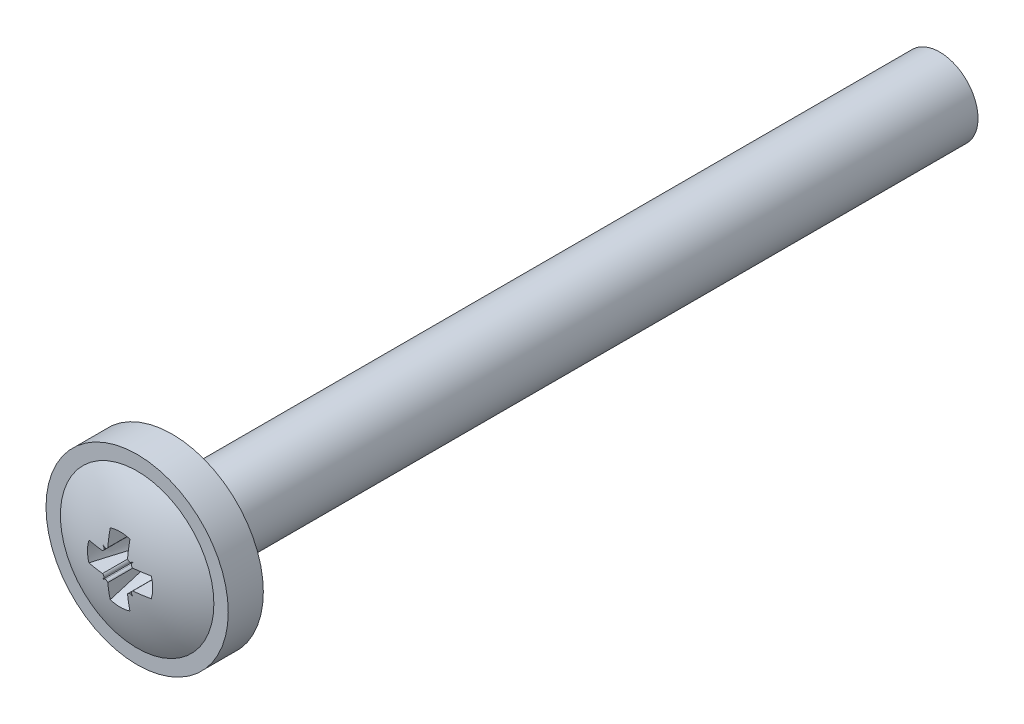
ISO-10303-21;
HEADER;
FILE_DESCRIPTION(('STEP AP214'),'2;1');
FILE_NAME('part.step','',(''),(''),'','','');
FILE_SCHEMA(('AUTOMOTIVE_DESIGN { 1 0 10303 214 1 1 1 1 }'));
ENDSEC;
DATA;
#1=APPLICATION_CONTEXT('core data for automotive mechanical design processes');
#2=APPLICATION_PROTOCOL_DEFINITION('international standard','automotive_design',2000,#1);
#3=PRODUCT_CONTEXT('',#1,'mechanical');
#4=PRODUCT('Part','Part','',(#3));
#5=PRODUCT_RELATED_PRODUCT_CATEGORY('part','',(#4));
#6=PRODUCT_DEFINITION_FORMATION('','',#4);
#7=PRODUCT_DEFINITION_CONTEXT('part definition',#1,'design');
#8=PRODUCT_DEFINITION('design','',#6,#7);
#9=PRODUCT_DEFINITION_SHAPE('','',#8);
#10=(LENGTH_UNIT() NAMED_UNIT(*) SI_UNIT(.MILLI.,.METRE.));
#11=(NAMED_UNIT(*) PLANE_ANGLE_UNIT() SI_UNIT($,.RADIAN.));
#12=(NAMED_UNIT(*) SI_UNIT($,.STERADIAN.) SOLID_ANGLE_UNIT());
#13=UNCERTAINTY_MEASURE_WITH_UNIT(LENGTH_MEASURE(1.E-05),#10,'distance_accuracy_value','');
#14=(GEOMETRIC_REPRESENTATION_CONTEXT(3) GLOBAL_UNCERTAINTY_ASSIGNED_CONTEXT((#13)) GLOBAL_UNIT_ASSIGNED_CONTEXT((#10,
#11,#12)) REPRESENTATION_CONTEXT('',''));
#15=CARTESIAN_POINT('',(0.,0.,0.));
#16=DIRECTION('',(0.,0.,1.));
#17=DIRECTION('',(1.,0.,0.));
#18=AXIS2_PLACEMENT_3D('',#15,#16,#17);
#19=CARTESIAN_POINT('',(0.,0.,-5.1));
#20=DIRECTION('',(1.,0.,0.));
#21=DIRECTION('',(0.,0.,-1.));
#22=AXIS2_PLACEMENT_3D('',#19,#20,#21);
#23=SPHERICAL_SURFACE('',#22,8.);
#24=CARTESIAN_POINT('',(0.,0.,1.82820323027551));
#25=DIRECTION('',(0.,0.,1.));
#26=DIRECTION('',(1.,0.,0.));
#27=AXIS2_PLACEMENT_3D('',#24,#25,#26);
#28=CIRCLE('',#27,4.);
#29=CARTESIAN_POINT('',(4.,0.,1.82820323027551));
#30=VERTEX_POINT('',#29);
#31=EDGE_CURVE('E309',#30,#30,#28,.T.);
#32=ORIENTED_EDGE('',*,*,#31,.T.);
#33=EDGE_LOOP('',(#32));
#34=FACE_BOUND('',#33,.T.);
#35=CARTESIAN_POINT('',(0.0255182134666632,-0.730746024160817,-5.1));
#36=DIRECTION('',(-0.0348994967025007,0.999390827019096,0.));
#37=DIRECTION('',(0.999390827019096,0.0348994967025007,0.));
#38=AXIS2_PLACEMENT_3D('',#35,#36,#37);
#39=CIRCLE('',#38,7.96651486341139);
#40=CARTESIAN_POINT('',(0.641767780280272,-0.709226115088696,2.84261496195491));
#41=VERTEX_POINT('',#40);
#42=CARTESIAN_POINT('',(0.673287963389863,-0.708125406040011,2.84010338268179));
#43=VERTEX_POINT('',#42);
#44=EDGE_CURVE('E11',#41,#43,#39,.T.);
#45=ORIENTED_EDGE('',*,*,#44,.F.);
#46=CARTESIAN_POINT('',(0.641767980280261,-0.709226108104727,2.84261494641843));
#47=CARTESIAN_POINT('',(0.633401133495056,-0.709510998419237,2.84326568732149));
#48=CARTESIAN_POINT('',(0.625054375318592,-0.710510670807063,2.8438374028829));
#49=CARTESIAN_POINT('',(0.608647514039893,-0.713882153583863,2.84480900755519));
#50=CARTESIAN_POINT('',(0.600586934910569,-0.716251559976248,2.84520919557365));
#51=CARTESIAN_POINT('',(0.584960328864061,-0.722309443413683,2.84582663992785));
#52=CARTESIAN_POINT('',(0.577394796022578,-0.725999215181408,2.84604371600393));
#53=CARTESIAN_POINT('',(0.562982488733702,-0.734591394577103,2.84628823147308));
#54=CARTESIAN_POINT('',(0.556135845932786,-0.739494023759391,2.84631563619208));
#55=CARTESIAN_POINT('',(0.542704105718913,-0.750935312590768,2.84617226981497));
#56=CARTESIAN_POINT('',(0.536217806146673,-0.757590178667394,2.84598089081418));
#57=CARTESIAN_POINT('',(0.524559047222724,-0.771987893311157,2.84537347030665));
#58=CARTESIAN_POINT('',(0.519390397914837,-0.779733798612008,2.84495678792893));
#59=CARTESIAN_POINT('',(0.514999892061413,-0.787893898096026,2.84443190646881));
#60=B_SPLINE_CURVE_WITH_KNOTS('',3,(#46,#47,#48,#49,#50,#51,#52,#53,#54,#55,#56,#57,#58,#59),
.UNSPECIFIED.,.F.,.F.,(4,2,2,2,2,2,4),(0.,0.0251588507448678,0.0502736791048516,
0.0754132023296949,0.10055732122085,0.128279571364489,0.156081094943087),.UNSPECIFIED.);
#61=CARTESIAN_POINT('',(0.51499999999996,-0.787893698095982,2.84443191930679));
#62=VERTEX_POINT('',#61);
#63=EDGE_CURVE('E993',#41,#62,#60,.T.);
#64=ORIENTED_EDGE('',*,*,#63,.T.);
#65=CARTESIAN_POINT('',(0.514999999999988,0.,-5.1));
#66=DIRECTION('',(1.,0.,0.));
#67=DIRECTION('',(0.,0.,-1.));
#68=AXIS2_PLACEMENT_3D('',#65,#66,#67);
#69=CIRCLE('',#68,7.98340622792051);
#70=CARTESIAN_POINT('',(0.514999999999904,-1.62362725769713,2.71655995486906));
#71=VERTEX_POINT('',#70);
#72=EDGE_CURVE('E983',#62,#71,#69,.T.);
#73=ORIENTED_EDGE('',*,*,#72,.T.);
#74=CARTESIAN_POINT('',(0.,0.,2.71655995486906));
#75=DIRECTION('',(0.,0.,-1.));
#76=DIRECTION('',(0.,1.,0.));
#77=AXIS2_PLACEMENT_3D('',#74,#75,#76);
#78=CIRCLE('',#77,1.7033468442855);
#79=CARTESIAN_POINT('',(-0.515000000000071,-1.62362725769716,2.71655995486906));
#80=VERTEX_POINT('',#79);
#81=EDGE_CURVE('E984',#71,#80,#78,.T.);
#82=ORIENTED_EDGE('',*,*,#81,.T.);
#83=CARTESIAN_POINT('',(-0.515000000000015,0.,-5.1));
#84=DIRECTION('',(1.,0.,0.));
#85=DIRECTION('',(0.,-1.,0.));
#86=AXIS2_PLACEMENT_3D('',#83,#84,#85);
#87=CIRCLE('',#86,7.98340622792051);
#88=CARTESIAN_POINT('',(-0.515000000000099,-0.787893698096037,2.84443191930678));
#89=VERTEX_POINT('',#88);
#90=EDGE_CURVE('E1013',#89,#80,#87,.T.);
#91=ORIENTED_EDGE('',*,*,#90,.F.);
#92=CARTESIAN_POINT('',(-0.641767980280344,-0.709226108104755,2.84261494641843));
#93=CARTESIAN_POINT('',(-0.633401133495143,-0.709510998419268,2.84326568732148));
#94=CARTESIAN_POINT('',(-0.625054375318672,-0.710510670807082,2.8438374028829));
#95=CARTESIAN_POINT('',(-0.608647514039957,-0.713882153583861,2.84480900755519));
#96=CARTESIAN_POINT('',(-0.600586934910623,-0.716251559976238,2.84520919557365));
#97=CARTESIAN_POINT('',(-0.584960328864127,-0.72230944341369,2.84582663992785));
#98=CARTESIAN_POINT('',(-0.577394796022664,-0.725999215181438,2.84604371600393));
#99=CARTESIAN_POINT('',(-0.562982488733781,-0.734591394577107,2.84628823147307));
#100=CARTESIAN_POINT('',(-0.556135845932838,-0.739494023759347,2.84631563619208));
#101=CARTESIAN_POINT('',(-0.542704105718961,-0.750935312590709,2.84617226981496));
#102=CARTESIAN_POINT('',(-0.536217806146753,-0.757590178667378,2.84598089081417));
#103=CARTESIAN_POINT('',(-0.524559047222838,-0.771987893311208,2.84537347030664));
#104=CARTESIAN_POINT('',(-0.519390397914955,-0.779733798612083,2.84495678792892));
#105=CARTESIAN_POINT('',(-0.514999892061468,-0.787893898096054,2.84443190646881));
#106=B_SPLINE_CURVE_WITH_KNOTS('',3,(#92,#93,#94,#95,#96,#97,#98,#99,#100,#101,#102,#103,#104,
#105),.UNSPECIFIED.,.F.,.F.,(4,2,2,2,2,2,4),(0.,0.025158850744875,0.0502736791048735,
0.0754132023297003,0.100557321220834,0.128279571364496,0.156081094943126),.UNSPECIFIED.);
#107=CARTESIAN_POINT('',(-0.641767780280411,-0.709226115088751,2.84261496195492));
#108=VERTEX_POINT('',#107);
#109=EDGE_CURVE('E1007',#108,#89,#106,.T.);
#110=ORIENTED_EDGE('',*,*,#109,.F.);
#111=CARTESIAN_POINT('',(-0.0255182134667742,-0.730746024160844,-5.1));
#112=DIRECTION('',(-0.0348994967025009,-0.999390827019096,0.));
#113=DIRECTION('',(-0.999390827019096,0.0348994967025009,0.));
#114=AXIS2_PLACEMENT_3D('',#111,#112,#113);
#115=CIRCLE('',#114,7.96651486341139);
#116=CARTESIAN_POINT('',(-0.673287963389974,-0.708125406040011,2.8401033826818));
#117=VERTEX_POINT('',#116);
#118=EDGE_CURVE('E1014',#108,#117,#115,.T.);
#119=ORIENTED_EDGE('',*,*,#118,.T.);
#120=CARTESIAN_POINT('',(-2.7006322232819,2.7006322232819,-2.16937050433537));
#121=DIRECTION('',(-0.560985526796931,0.560985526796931,0.608761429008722));
#122=DIRECTION('',(0.,-0.735373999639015,0.677661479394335));
#123=AXIS2_PLACEMENT_3D('',#120,#121,#122);
#124=CIRCLE('',#123,6.38941170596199);
#125=CARTESIAN_POINT('',(-0.756578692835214,-0.776344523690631,2.8262145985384));
#126=VERTEX_POINT('',#125);
#127=EDGE_CURVE('E1119',#126,#117,#124,.T.);
#128=ORIENTED_EDGE('',*,*,#127,.F.);
#129=CARTESIAN_POINT('',(0.588527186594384,0.58852718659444,2.61961152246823));
#130=DIRECTION('',(0.0757986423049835,0.0757986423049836,0.994237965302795));
#131=DIRECTION('',(0.997106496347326,0.,-0.0760173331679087));
#132=AXIS2_PLACEMENT_3D('',#129,#130,#131);
#133=CIRCLE('',#132,1.92739965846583);
#134=CARTESIAN_POINT('',(-0.776344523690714,-0.756578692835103,2.8262145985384));
#135=VERTEX_POINT('',#134);
#136=EDGE_CURVE('E1123',#135,#126,#133,.T.);
#137=ORIENTED_EDGE('',*,*,#136,.F.);
#138=CARTESIAN_POINT('',(2.70063222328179,-2.70063222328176,-2.16937050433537));
#139=DIRECTION('',(-0.560985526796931,0.560985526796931,-0.60876142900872));
#140=DIRECTION('',(-0.735373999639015,0.,0.677661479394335));
#141=AXIS2_PLACEMENT_3D('',#138,#139,#140);
#142=CIRCLE('',#141,6.38941170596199);
#143=CARTESIAN_POINT('',(-0.708125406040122,-0.67328796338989,2.8401033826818));
#144=VERTEX_POINT('',#143);
#145=EDGE_CURVE('E1129',#135,#144,#142,.T.);
#146=ORIENTED_EDGE('',*,*,#145,.T.);
#147=CARTESIAN_POINT('',(-0.730746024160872,-0.0255182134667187,-5.1));
#148=DIRECTION('',(0.999390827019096,0.0348994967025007,0.));
#149=DIRECTION('',(0.0348994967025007,-0.999390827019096,0.));
#150=AXIS2_PLACEMENT_3D('',#147,#148,#149);
#151=CIRCLE('',#150,7.96651486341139);
#152=CARTESIAN_POINT('',(-0.709226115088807,-0.6417677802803,2.84261496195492));
#153=VERTEX_POINT('',#152);
#154=EDGE_CURVE('E584',#153,#144,#151,.T.);
#155=ORIENTED_EDGE('',*,*,#154,.F.);
#156=CARTESIAN_POINT('',(-0.709226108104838,-0.641767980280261,2.84261494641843));
#157=CARTESIAN_POINT('',(-0.709510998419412,-0.633401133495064,2.84326568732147));
#158=CARTESIAN_POINT('',(-0.710510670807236,-0.625054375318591,2.84383740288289));
#159=CARTESIAN_POINT('',(-0.713882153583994,-0.608647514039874,2.84480900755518));
#160=CARTESIAN_POINT('',(-0.71625155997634,-0.600586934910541,2.84520919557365));
#161=CARTESIAN_POINT('',(-0.722309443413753,-0.584960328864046,2.84582663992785));
#162=CARTESIAN_POINT('',(-0.725999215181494,-0.577394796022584,2.84604371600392));
#163=CARTESIAN_POINT('',(-0.734591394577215,-0.562982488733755,2.84628823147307));
#164=CARTESIAN_POINT('',(-0.739494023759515,-0.556135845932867,2.84631563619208));
#165=CARTESIAN_POINT('',(-0.750935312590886,-0.542704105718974,2.84617226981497));
#166=CARTESIAN_POINT('',(-0.757590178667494,-0.536217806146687,2.84598089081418));
#167=CARTESIAN_POINT('',(-0.771987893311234,-0.524559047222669,2.84537347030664));
#168=CARTESIAN_POINT('',(-0.77973379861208,-0.51939039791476,2.84495678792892));
#169=CARTESIAN_POINT('',(-0.787893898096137,-0.514999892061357,2.84443190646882));
#170=B_SPLINE_CURVE_WITH_KNOTS('',3,(#156,#157,#158,#159,#160,#161,#162,#163,#164,#165,#166,
#167,#168,#169),.UNSPECIFIED.,.F.,.F.,(4,2,2,2,2,2,4),(0.,0.0251588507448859,0.0502736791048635,
0.0754132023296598,0.10055732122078,0.128279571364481,0.156081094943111),.UNSPECIFIED.);
#171=CARTESIAN_POINT('',(-0.787893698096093,-0.515000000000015,2.84443191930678));
#172=VERTEX_POINT('',#171);
#173=EDGE_CURVE('E578',#153,#172,#170,.T.);
#174=ORIENTED_EDGE('',*,*,#173,.T.);
#175=CARTESIAN_POINT('',(0.,-0.514999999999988,-5.1));
#176=DIRECTION('',(0.,1.,0.));
#177=DIRECTION('',(1.,0.,0.));
#178=AXIS2_PLACEMENT_3D('',#175,#176,#177);
#179=CIRCLE('',#178,7.98340622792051);
#180=CARTESIAN_POINT('',(-1.62362725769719,-0.514999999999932,2.71655995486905));
#181=VERTEX_POINT('',#180);
#182=EDGE_CURVE('E569',#181,#172,#179,.T.);
#183=ORIENTED_EDGE('',*,*,#182,.F.);
#184=CARTESIAN_POINT('',(0.,0.,2.71655995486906));
#185=DIRECTION('',(0.,0.,-1.));
#186=DIRECTION('',(0.,1.,0.));
#187=AXIS2_PLACEMENT_3D('',#184,#185,#186);
#188=CIRCLE('',#187,1.7033468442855);
#189=CARTESIAN_POINT('',(-1.62362725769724,0.515000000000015,2.71655995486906));
#190=VERTEX_POINT('',#189);
#191=EDGE_CURVE('E563',#181,#190,#188,.T.);
#192=ORIENTED_EDGE('',*,*,#191,.T.);
#193=CARTESIAN_POINT('',(0.,0.515000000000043,-5.1));
#194=DIRECTION('',(0.,1.,0.));
#195=DIRECTION('',(1.,0.,0.));
#196=AXIS2_PLACEMENT_3D('',#193,#194,#195);
#197=CIRCLE('',#196,7.98340622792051);
#198=CARTESIAN_POINT('',(-0.787893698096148,0.515000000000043,2.84443191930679));
#199=VERTEX_POINT('',#198);
#200=EDGE_CURVE('E610',#190,#199,#197,.T.);
#201=ORIENTED_EDGE('',*,*,#200,.T.);
#202=CARTESIAN_POINT('',(-0.709226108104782,0.6417679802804,2.84261494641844));
#203=CARTESIAN_POINT('',(-0.709510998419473,0.633401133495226,2.84326568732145));
#204=CARTESIAN_POINT('',(-0.710510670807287,0.625054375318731,2.84383740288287));
#205=CARTESIAN_POINT('',(-0.713882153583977,0.608647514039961,2.84480900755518));
#206=CARTESIAN_POINT('',(-0.716251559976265,0.600586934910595,2.84520919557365));
#207=CARTESIAN_POINT('',(-0.722309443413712,0.584960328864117,2.84582663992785));
#208=CARTESIAN_POINT('',(-0.725999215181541,0.577394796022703,2.84604371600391));
#209=CARTESIAN_POINT('',(-0.734591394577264,0.562982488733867,2.84628823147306));
#210=CARTESIAN_POINT('',(-0.739494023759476,0.556135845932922,2.84631563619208));
#211=CARTESIAN_POINT('',(-0.750935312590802,0.542704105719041,2.84617226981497));
#212=CARTESIAN_POINT('',(-0.757590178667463,0.536217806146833,2.84598089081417));
#213=CARTESIAN_POINT('',(-0.771987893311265,0.524559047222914,2.84537347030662));
#214=CARTESIAN_POINT('',(-0.779733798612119,0.519390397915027,2.8449567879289));
#215=CARTESIAN_POINT('',(-0.787893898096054,0.514999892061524,2.84443190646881));
#216=B_SPLINE_CURVE_WITH_KNOTS('',3,(#202,#203,#204,#205,#206,#207,#208,#209,#210,#211,#212,
#213,#214,#215),.UNSPECIFIED.,.F.,.F.,(4,2,2,2,2,2,4),(0.,0.0251588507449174,0.050273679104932,
0.0754132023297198,0.100557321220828,0.12827957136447,0.156081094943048),.UNSPECIFIED.);
#217=CARTESIAN_POINT('',(-0.709226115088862,0.641767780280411,2.84261496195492));
#218=VERTEX_POINT('',#217);
#219=EDGE_CURVE('E602',#218,#199,#216,.T.);
#220=ORIENTED_EDGE('',*,*,#219,.F.);
#221=CARTESIAN_POINT('',(-0.730746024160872,0.0255182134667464,-5.1));
#222=DIRECTION('',(-0.999390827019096,0.0348994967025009,0.));
#223=DIRECTION('',(0.0348994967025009,0.999390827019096,0.));
#224=AXIS2_PLACEMENT_3D('',#221,#222,#223);
#225=CIRCLE('',#224,7.96651486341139);
#226=CARTESIAN_POINT('',(-0.708125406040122,0.673287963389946,2.84010338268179));
#227=VERTEX_POINT('',#226);
#228=EDGE_CURVE('E40',#218,#227,#225,.T.);
#229=ORIENTED_EDGE('',*,*,#228,.T.);
#230=CARTESIAN_POINT('',(2.70063222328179,2.7006322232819,-2.16937050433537));
#231=DIRECTION('',(0.560985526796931,0.560985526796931,0.608761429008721));
#232=DIRECTION('',(0.735373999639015,0.,-0.677661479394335));
#233=AXIS2_PLACEMENT_3D('',#230,#231,#232);
#234=CIRCLE('',#233,6.38941170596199);
#235=CARTESIAN_POINT('',(-0.776344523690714,0.756578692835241,2.82621459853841));
#236=VERTEX_POINT('',#235);
#237=EDGE_CURVE('E344',#236,#227,#234,.T.);
#238=ORIENTED_EDGE('',*,*,#237,.F.);
#239=CARTESIAN_POINT('',(0.588527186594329,-0.588527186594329,2.61961152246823));
#240=DIRECTION('',(0.0757986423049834,-0.0757986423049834,0.994237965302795));
#241=DIRECTION('',(0.997106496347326,0.,-0.0760173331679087));
#242=AXIS2_PLACEMENT_3D('',#239,#240,#241);
#243=CIRCLE('',#242,1.92739965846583);
#244=CARTESIAN_POINT('',(-0.756578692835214,0.776344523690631,2.82621459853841));
#245=VERTEX_POINT('',#244);
#246=EDGE_CURVE('E339',#245,#236,#243,.T.);
#247=ORIENTED_EDGE('',*,*,#246,.F.);
#248=CARTESIAN_POINT('',(-2.70063222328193,-2.70063222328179,-2.16937050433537));
#249=DIRECTION('',(0.560985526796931,0.560985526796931,-0.608761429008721));
#250=DIRECTION('',(-0.735373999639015,0.,-0.677661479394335));
#251=AXIS2_PLACEMENT_3D('',#248,#249,#250);
#252=CIRCLE('',#251,6.38941170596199);
#253=CARTESIAN_POINT('',(-0.673287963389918,0.70812540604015,2.84010338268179));
#254=VERTEX_POINT('',#253);
#255=EDGE_CURVE('E341',#245,#254,#252,.T.);
#256=ORIENTED_EDGE('',*,*,#255,.T.);
#257=CARTESIAN_POINT('',(-0.0255182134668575,0.730746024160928,-5.1));
#258=DIRECTION('',(0.0348994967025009,-0.999390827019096,0.));
#259=DIRECTION('',(-0.999390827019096,-0.0348994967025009,0.));
#260=AXIS2_PLACEMENT_3D('',#257,#258,#259);
#261=CIRCLE('',#260,7.96651486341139);
#262=CARTESIAN_POINT('',(-0.641767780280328,0.709226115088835,2.84261496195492));
#263=VERTEX_POINT('',#262);
#264=EDGE_CURVE('E346',#263,#254,#261,.T.);
#265=ORIENTED_EDGE('',*,*,#264,.F.);
#266=CARTESIAN_POINT('',(-0.641767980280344,0.70922610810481,2.84261494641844));
#267=CARTESIAN_POINT('',(-0.633401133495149,0.709510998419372,2.84326568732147));
#268=CARTESIAN_POINT('',(-0.625054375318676,0.710510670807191,2.84383740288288));
#269=CARTESIAN_POINT('',(-0.608647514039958,0.713882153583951,2.84480900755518));
#270=CARTESIAN_POINT('',(-0.600586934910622,0.716251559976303,2.84520919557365));
#271=CARTESIAN_POINT('',(-0.584960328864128,0.722309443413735,2.84582663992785));
#272=CARTESIAN_POINT('',(-0.577394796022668,0.725999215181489,2.84604371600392));
#273=CARTESIAN_POINT('',(-0.562982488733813,0.734591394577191,2.84628823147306));
#274=CARTESIAN_POINT('',(-0.556135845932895,0.739494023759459,2.84631563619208));
#275=CARTESIAN_POINT('',(-0.542704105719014,0.75093531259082,2.84617226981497));
#276=CARTESIAN_POINT('',(-0.536217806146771,0.757590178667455,2.84598089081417));
#277=CARTESIAN_POINT('',(-0.524559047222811,0.771987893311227,2.84537347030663));
#278=CARTESIAN_POINT('',(-0.519390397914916,0.77973379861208,2.84495678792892));
#279=CARTESIAN_POINT('',(-0.514999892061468,0.787893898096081,2.84443190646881));
#280=B_SPLINE_CURVE_WITH_KNOTS('',3,(#266,#267,#268,#269,#270,#271,#272,#273,#274,#275,#276,
#277,#278,#279),.UNSPECIFIED.,.F.,.F.,(4,2,2,2,2,2,4),(0.,0.0251588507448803,0.050273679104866,
0.0754132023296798,0.100557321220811,0.128279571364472,0.156081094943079),.UNSPECIFIED.);
#281=CARTESIAN_POINT('',(-0.515000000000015,0.78789369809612,2.84443191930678));
#282=VERTEX_POINT('',#281);
#283=EDGE_CURVE('E348',#263,#282,#280,.T.);
#284=ORIENTED_EDGE('',*,*,#283,.T.);
#285=CARTESIAN_POINT('',(-0.515000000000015,0.,-5.1));
#286=DIRECTION('',(1.,0.,0.));
#287=DIRECTION('',(0.,0.,-1.));
#288=AXIS2_PLACEMENT_3D('',#285,#286,#287);
#289=CIRCLE('',#288,7.98340622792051);
#290=CARTESIAN_POINT('',(-0.515000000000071,1.6236272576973,2.71655995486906));
#291=VERTEX_POINT('',#290);
#292=EDGE_CURVE('E355',#291,#282,#289,.T.);
#293=ORIENTED_EDGE('',*,*,#292,.F.);
#294=CARTESIAN_POINT('',(0.,0.,2.71655995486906));
#295=DIRECTION('',(0.,0.,-1.));
#296=DIRECTION('',(0.,1.,0.));
#297=AXIS2_PLACEMENT_3D('',#294,#295,#296);
#298=CIRCLE('',#297,1.7033468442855);
#299=CARTESIAN_POINT('',(0.51499999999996,1.62362725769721,2.71655995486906));
#300=VERTEX_POINT('',#299);
#301=EDGE_CURVE('E1090',#291,#300,#298,.T.);
#302=ORIENTED_EDGE('',*,*,#301,.T.);
#303=CARTESIAN_POINT('',(0.514999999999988,0.,-5.1));
#304=DIRECTION('',(1.,0.,0.));
#305=DIRECTION('',(0.,0.,-1.));
#306=AXIS2_PLACEMENT_3D('',#303,#304,#305);
#307=CIRCLE('',#306,7.98340622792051);
#308=CARTESIAN_POINT('',(0.51499999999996,0.787893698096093,2.84443191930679));
#309=VERTEX_POINT('',#308);
#310=EDGE_CURVE('E608',#300,#309,#307,.T.);
#311=ORIENTED_EDGE('',*,*,#310,.T.);
#312=CARTESIAN_POINT('',(0.641767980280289,0.70922610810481,2.84261494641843));
#313=CARTESIAN_POINT('',(0.633401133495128,0.709510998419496,2.84326568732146));
#314=CARTESIAN_POINT('',(0.625054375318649,0.710510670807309,2.84383740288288));
#315=CARTESIAN_POINT('',(0.608647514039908,0.713882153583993,2.84480900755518));
#316=CARTESIAN_POINT('',(0.600586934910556,0.716251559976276,2.84520919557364));
#317=CARTESIAN_POINT('',(0.584960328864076,0.72230944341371,2.84582663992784));
#318=CARTESIAN_POINT('',(0.577394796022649,0.725999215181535,2.84604371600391));
#319=CARTESIAN_POINT('',(0.562982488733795,0.734591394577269,2.84628823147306));
#320=CARTESIAN_POINT('',(0.556135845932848,0.739494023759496,2.84631563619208));
#321=CARTESIAN_POINT('',(0.542704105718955,0.750935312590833,2.84617226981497));
#322=CARTESIAN_POINT('',(0.536217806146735,0.757590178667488,2.84598089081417));
#323=CARTESIAN_POINT('',(0.5245590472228,0.771987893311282,2.84537347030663));
#324=CARTESIAN_POINT('',(0.519390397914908,0.779733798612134,2.84495678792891));
#325=CARTESIAN_POINT('',(0.514999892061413,0.787893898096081,2.84443190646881));
#326=B_SPLINE_CURVE_WITH_KNOTS('',3,(#312,#313,#314,#315,#316,#317,#318,#319,#320,#321,#322,
#323,#324,#325),.UNSPECIFIED.,.F.,.F.,(4,2,2,2,2,2,4),(0.,0.0251588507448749,0.0502736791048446,
0.0754132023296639,0.100557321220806,0.128279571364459,0.156081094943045),.UNSPECIFIED.);
#327=CARTESIAN_POINT('',(0.641767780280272,0.709226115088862,2.84261496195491));
#328=VERTEX_POINT('',#327);
#329=EDGE_CURVE('E556',#328,#309,#326,.T.);
#330=ORIENTED_EDGE('',*,*,#329,.F.);
#331=CARTESIAN_POINT('',(0.0255182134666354,0.730746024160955,-5.1));
#332=DIRECTION('',(0.0348994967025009,0.999390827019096,0.));
#333=DIRECTION('',(0.999390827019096,-0.0348994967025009,0.));
#334=AXIS2_PLACEMENT_3D('',#331,#332,#333);
#335=CIRCLE('',#334,7.96651486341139);
#336=CARTESIAN_POINT('',(0.673287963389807,0.70812540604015,2.84010338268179));
#337=VERTEX_POINT('',#336);
#338=EDGE_CURVE('E562',#328,#337,#335,.T.);
#339=ORIENTED_EDGE('',*,*,#338,.T.);
#340=CARTESIAN_POINT('',(2.70063222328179,-2.70063222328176,-2.16937050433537));
#341=DIRECTION('',(0.560985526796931,-0.560985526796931,0.60876142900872));
#342=DIRECTION('',(0.,-0.735373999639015,-0.677661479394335));
#343=AXIS2_PLACEMENT_3D('',#340,#341,#342);
#344=CIRCLE('',#343,6.38941170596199);
#345=CARTESIAN_POINT('',(0.756578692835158,0.776344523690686,2.8262145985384));
#346=VERTEX_POINT('',#345);
#347=EDGE_CURVE('E567',#346,#337,#344,.T.);
#348=ORIENTED_EDGE('',*,*,#347,.F.);
#349=CARTESIAN_POINT('',(-0.58852718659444,-0.588527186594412,2.61961152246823));
#350=DIRECTION('',(-0.0757986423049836,-0.0757986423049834,0.994237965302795));
#351=DIRECTION('',(0.997106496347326,0.,0.0760173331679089));
#352=AXIS2_PLACEMENT_3D('',#349,#350,#351);
#353=CIRCLE('',#352,1.92739965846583);
#354=CARTESIAN_POINT('',(0.776344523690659,0.756578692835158,2.8262145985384));
#355=VERTEX_POINT('',#354);
#356=EDGE_CURVE('E571',#355,#346,#353,.T.);
#357=ORIENTED_EDGE('',*,*,#356,.F.);
#358=CARTESIAN_POINT('',(-2.7006322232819,2.7006322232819,-2.16937050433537));
#359=DIRECTION('',(0.560985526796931,-0.560985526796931,-0.608761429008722));
#360=DIRECTION('',(0.,0.735373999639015,-0.677661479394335));
#361=AXIS2_PLACEMENT_3D('',#358,#359,#360);
#362=CIRCLE('',#361,6.38941170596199);
#363=CARTESIAN_POINT('',(0.708125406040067,0.673287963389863,2.84010338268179));
#364=VERTEX_POINT('',#363);
#365=EDGE_CURVE('E573',#355,#364,#362,.T.);
#366=ORIENTED_EDGE('',*,*,#365,.T.);
#367=CARTESIAN_POINT('',(0.730746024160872,0.0255182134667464,-5.1));
#368=DIRECTION('',(-0.999390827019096,-0.0348994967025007,0.));
#369=DIRECTION('',(-0.0348994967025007,0.999390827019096,0.));
#370=AXIS2_PLACEMENT_3D('',#367,#368,#369);
#371=CIRCLE('',#370,7.96651486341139);
#372=CARTESIAN_POINT('',(0.709226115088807,0.6417677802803,2.84261496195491));
#373=VERTEX_POINT('',#372);
#374=EDGE_CURVE('E576',#373,#364,#371,.T.);
#375=ORIENTED_EDGE('',*,*,#374,.F.);
#376=CARTESIAN_POINT('',(0.709226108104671,0.641767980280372,2.84261494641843));
#377=CARTESIAN_POINT('',(0.709510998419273,0.633401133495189,2.84326568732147));
#378=CARTESIAN_POINT('',(0.710510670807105,0.625054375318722,2.84383740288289));
#379=CARTESIAN_POINT('',(0.713882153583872,0.60864751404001,2.84480900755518));
#380=CARTESIAN_POINT('',(0.716251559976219,0.600586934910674,2.84520919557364));
#381=CARTESIAN_POINT('',(0.72230944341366,0.584960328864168,2.84582663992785));
#382=CARTESIAN_POINT('',(0.725999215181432,0.577394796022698,2.84604371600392));
#383=CARTESIAN_POINT('',(0.734591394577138,0.5629824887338,2.84628823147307));
#384=CARTESIAN_POINT('',(0.739494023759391,0.556135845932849,2.84631563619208));
#385=CARTESIAN_POINT('',(0.750935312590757,0.542704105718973,2.84617226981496));
#386=CARTESIAN_POINT('',(0.757590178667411,0.536217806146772,2.84598089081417));
#387=CARTESIAN_POINT('',(0.771987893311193,0.52455904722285,2.84537347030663));
#388=CARTESIAN_POINT('',(0.779733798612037,0.519390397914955,2.84495678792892));
#389=CARTESIAN_POINT('',(0.78789389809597,0.514999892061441,2.84443190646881));
#390=B_SPLINE_CURVE_WITH_KNOTS('',3,(#376,#377,#378,#379,#380,#381,#382,#383,#384,#385,#386,
#387,#388,#389),.UNSPECIFIED.,.F.,.F.,(4,2,2,2,2,2,4),(0.,0.0251588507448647,0.0502736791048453,
0.0754132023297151,0.100557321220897,0.128279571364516,0.156081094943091),.UNSPECIFIED.);
#391=CARTESIAN_POINT('',(0.787893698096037,0.515000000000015,2.84443191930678));
#392=VERTEX_POINT('',#391);
#393=EDGE_CURVE('E1125',#373,#392,#390,.T.);
#394=ORIENTED_EDGE('',*,*,#393,.T.);
#395=CARTESIAN_POINT('',(0.,0.515000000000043,-5.1));
#396=DIRECTION('',(0.,1.,0.));
#397=DIRECTION('',(1.,0.,0.));
#398=AXIS2_PLACEMENT_3D('',#395,#396,#397);
#399=CIRCLE('',#398,7.98340622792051);
#400=CARTESIAN_POINT('',(1.62362725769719,0.515000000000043,2.71655995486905));
#401=VERTEX_POINT('',#400);
#402=EDGE_CURVE('E1072',#392,#401,#399,.T.);
#403=ORIENTED_EDGE('',*,*,#402,.T.);
#404=CARTESIAN_POINT('',(0.,0.,2.71655995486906));
#405=DIRECTION('',(0.,0.,-1.));
#406=DIRECTION('',(0.,1.,0.));
#407=AXIS2_PLACEMENT_3D('',#404,#405,#406);
#408=CIRCLE('',#407,1.7033468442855);
#409=CARTESIAN_POINT('',(1.62362725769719,-0.514999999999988,2.71655995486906));
#410=VERTEX_POINT('',#409);
#411=EDGE_CURVE('E1117',#401,#410,#408,.T.);
#412=ORIENTED_EDGE('',*,*,#411,.T.);
#413=CARTESIAN_POINT('',(0.,-0.514999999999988,-5.1));
#414=DIRECTION('',(0.,1.,0.));
#415=DIRECTION('',(1.,0.,0.));
#416=AXIS2_PLACEMENT_3D('',#413,#414,#415);
#417=CIRCLE('',#416,7.98340622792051);
#418=CARTESIAN_POINT('',(0.787893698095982,-0.514999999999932,2.84443191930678));
#419=VERTEX_POINT('',#418);
#420=EDGE_CURVE('E1016',#419,#410,#417,.T.);
#421=ORIENTED_EDGE('',*,*,#420,.F.);
#422=CARTESIAN_POINT('',(0.709226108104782,-0.641767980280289,2.84261494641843));
#423=CARTESIAN_POINT('',(0.709510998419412,-0.633401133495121,2.84326568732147));
#424=CARTESIAN_POINT('',(0.71051067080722,-0.625054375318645,2.84383740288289));
#425=CARTESIAN_POINT('',(0.713882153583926,-0.608647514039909,2.84480900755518));
#426=CARTESIAN_POINT('',(0.716251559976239,-0.600586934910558,2.84520919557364));
#427=CARTESIAN_POINT('',(0.722309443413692,-0.584960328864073,2.84582663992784));
#428=CARTESIAN_POINT('',(0.725999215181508,-0.577394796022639,2.84604371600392));
#429=CARTESIAN_POINT('',(0.734591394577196,-0.562982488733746,2.84628823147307));
#430=CARTESIAN_POINT('',(0.739494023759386,-0.556135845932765,2.84631563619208));
#431=CARTESIAN_POINT('',(0.750935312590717,-0.542704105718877,2.84617226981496));
#432=CARTESIAN_POINT('',(0.757590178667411,-0.536217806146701,2.84598089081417));
#433=CARTESIAN_POINT('',(0.771987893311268,-0.524559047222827,2.84537347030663));
#434=CARTESIAN_POINT('',(0.779733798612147,-0.519390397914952,2.84495678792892));
#435=CARTESIAN_POINT('',(0.787893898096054,-0.514999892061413,2.84443190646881));
#436=B_SPLINE_CURVE_WITH_KNOTS('',3,(#422,#423,#424,#425,#426,#427,#428,#429,#430,#431,#432,
#433,#434,#435),.UNSPECIFIED.,.F.,.F.,(4,2,2,2,2,2,4),(0.,0.0251588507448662,0.050273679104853,
0.0754132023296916,0.100557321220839,0.128279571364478,0.156081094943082),.UNSPECIFIED.);
#437=CARTESIAN_POINT('',(0.709226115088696,-0.641767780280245,2.84261496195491));
#438=VERTEX_POINT('',#437);
#439=EDGE_CURVE('E977',#438,#419,#436,.T.);
#440=ORIENTED_EDGE('',*,*,#439,.F.);
#441=CARTESIAN_POINT('',(0.730746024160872,-0.0255182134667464,-5.1));
#442=DIRECTION('',(0.999390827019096,-0.0348994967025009,0.));
#443=DIRECTION('',(-0.0348994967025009,-0.999390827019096,0.));
#444=AXIS2_PLACEMENT_3D('',#441,#442,#443);
#445=CIRCLE('',#444,7.96651486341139);
#446=CARTESIAN_POINT('',(0.708125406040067,-0.673287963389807,2.84010338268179));
#447=VERTEX_POINT('',#446);
#448=EDGE_CURVE('E988',#438,#447,#445,.T.);
#449=ORIENTED_EDGE('',*,*,#448,.T.);
#450=CARTESIAN_POINT('',(-2.70063222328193,-2.70063222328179,-2.16937050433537));
#451=DIRECTION('',(-0.560985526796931,-0.560985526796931,0.608761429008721));
#452=DIRECTION('',(0.735373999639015,0.,0.677661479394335));
#453=AXIS2_PLACEMENT_3D('',#450,#451,#452);
#454=CIRCLE('',#453,6.38941170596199);
#455=CARTESIAN_POINT('',(0.776344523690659,-0.756578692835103,2.8262145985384));
#456=VERTEX_POINT('',#455);
#457=EDGE_CURVE('E991',#456,#447,#454,.T.);
#458=ORIENTED_EDGE('',*,*,#457,.F.);
#459=CARTESIAN_POINT('',(-0.58852718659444,0.588527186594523,2.61961152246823));
#460=DIRECTION('',(-0.0757986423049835,0.0757986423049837,0.994237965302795));
#461=DIRECTION('',(0.,-0.997106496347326,0.0760173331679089));
#462=AXIS2_PLACEMENT_3D('',#459,#460,#461);
#463=CIRCLE('',#462,1.92739965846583);
#464=CARTESIAN_POINT('',(0.756578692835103,-0.776344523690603,2.8262145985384));
#465=VERTEX_POINT('',#464);
#466=EDGE_CURVE('E999',#465,#456,#463,.T.);
#467=ORIENTED_EDGE('',*,*,#466,.F.);
#468=CARTESIAN_POINT('',(2.70063222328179,2.7006322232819,-2.16937050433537));
#469=DIRECTION('',(-0.560985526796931,-0.560985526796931,-0.608761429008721));
#470=DIRECTION('',(-0.735373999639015,0.,0.677661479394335));
#471=AXIS2_PLACEMENT_3D('',#468,#469,#470);
#472=CIRCLE('',#471,6.38941170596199);
#473=EDGE_CURVE('E25',#465,#43,#472,.T.);
#474=ORIENTED_EDGE('',*,*,#473,.T.);
#475=EDGE_LOOP('',(#45,#64,#73,#82,#91,#110,#119,#128,#137,#146,#155,#174,#183,#192,#201,#220,
#229,#238,#247,#256,#265,#284,#293,#302,#311,#330,#339,#348,#357,#366,#375,#394,#403,#412,#421,
#440,#449,#458,#467,#474));
#476=FACE_BOUND('',#475,.T.);
#477=ADVANCED_FACE('F17',(#34,#476),#23,.T.);
#478=CARTESIAN_POINT('',(0.,0.,-40.));
#479=DIRECTION('',(0.,0.,1.));
#480=DIRECTION('',(1.,0.,0.));
#481=AXIS2_PLACEMENT_3D('',#478,#479,#480);
#482=PLANE('',#481);
#483=CARTESIAN_POINT('',(0.,0.,-40.));
#484=DIRECTION('',(0.,0.,1.));
#485=DIRECTION('',(1.,0.,0.));
#486=AXIS2_PLACEMENT_3D('',#483,#484,#485);
#487=CIRCLE('',#486,2.);
#488=CARTESIAN_POINT('',(1.99999999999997,0.,-40.));
#489=VERTEX_POINT('',#488);
#490=EDGE_CURVE('E336',#489,#489,#487,.T.);
#491=ORIENTED_EDGE('',*,*,#490,.F.);
#492=EDGE_LOOP('',(#491));
#493=FACE_BOUND('',#492,.T.);
#494=ADVANCED_FACE('F702',(#493),#482,.F.);
#495=CARTESIAN_POINT('',(0.,0.,0.));
#496=DIRECTION('',(0.,0.,1.));
#497=DIRECTION('',(1.,0.,0.));
#498=AXIS2_PLACEMENT_3D('',#495,#496,#497);
#499=CYLINDRICAL_SURFACE('',#498,2.);
#500=CARTESIAN_POINT('',(0.,0.,-1.778875));
#501=DIRECTION('',(0.,0.,1.));
#502=DIRECTION('',(1.,0.,0.));
#503=AXIS2_PLACEMENT_3D('',#500,#501,#502);
#504=CIRCLE('',#503,2.);
#505=CARTESIAN_POINT('',(2.,0.,-1.778875));
#506=VERTEX_POINT('',#505);
#507=EDGE_CURVE('E333',#506,#506,#504,.T.);
#508=ORIENTED_EDGE('',*,*,#507,.F.);
#509=EDGE_LOOP('',(#508));
#510=FACE_BOUND('',#509,.T.);
#511=ORIENTED_EDGE('',*,*,#490,.T.);
#512=EDGE_LOOP('',(#511));
#513=FACE_BOUND('',#512,.T.);
#514=ADVANCED_FACE('F708',(#510,#513),#499,.T.);
#515=CARTESIAN_POINT('',(0.,0.,-1.778875));
#516=DIRECTION('',(0.,0.,-1.));
#517=DIRECTION('',(-1.,0.,0.));
#518=AXIS2_PLACEMENT_3D('',#515,#516,#517);
#519=CONICAL_SURFACE('',#518,2.,0.785398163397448);
#520=CARTESIAN_POINT('',(0.,0.,-1.4));
#521=DIRECTION('',(0.,0.,1.));
#522=DIRECTION('',(1.,0.,0.));
#523=AXIS2_PLACEMENT_3D('',#520,#521,#522);
#524=CIRCLE('',#523,1.621125);
#525=CARTESIAN_POINT('',(1.621125,0.,-1.4));
#526=VERTEX_POINT('',#525);
#527=EDGE_CURVE('E330',#526,#526,#524,.T.);
#528=ORIENTED_EDGE('',*,*,#527,.F.);
#529=EDGE_LOOP('',(#528));
#530=FACE_BOUND('',#529,.T.);
#531=ORIENTED_EDGE('',*,*,#507,.T.);
#532=EDGE_LOOP('',(#531));
#533=FACE_BOUND('',#532,.T.);
#534=ADVANCED_FACE('F746',(#530,#533),#519,.T.);
#535=CARTESIAN_POINT('',(0.,0.,0.));
#536=DIRECTION('',(0.,0.,1.));
#537=DIRECTION('',(1.,0.,0.));
#538=AXIS2_PLACEMENT_3D('',#535,#536,#537);
#539=CYLINDRICAL_SURFACE('',#538,1.621125);
#540=CARTESIAN_POINT('',(0.,0.,-1.));
#541=DIRECTION('',(0.,0.,1.));
#542=DIRECTION('',(1.,0.,0.));
#543=AXIS2_PLACEMENT_3D('',#540,#541,#542);
#544=CIRCLE('',#543,1.621125);
#545=CARTESIAN_POINT('',(1.621125,0.,-1.));
#546=VERTEX_POINT('',#545);
#547=EDGE_CURVE('E327',#546,#546,#544,.T.);
#548=ORIENTED_EDGE('',*,*,#547,.F.);
#549=EDGE_LOOP('',(#548));
#550=FACE_BOUND('',#549,.T.);
#551=ORIENTED_EDGE('',*,*,#527,.T.);
#552=EDGE_LOOP('',(#551));
#553=FACE_BOUND('',#552,.T.);
#554=ADVANCED_FACE('F742',(#550,#553),#539,.T.);
#555=CARTESIAN_POINT('',(0.,0.,-1.));
#556=DIRECTION('',(0.,0.,1.));
#557=DIRECTION('',(1.,0.,0.));
#558=AXIS2_PLACEMENT_3D('',#555,#556,#557);
#559=TOROIDAL_SURFACE('',#558,1.821125,0.2);
#560=ORIENTED_EDGE('',*,*,#547,.T.);
#561=EDGE_LOOP('',(#560));
#562=FACE_BOUND('',#561,.T.);
#563=CARTESIAN_POINT('',(0.,0.,-0.889704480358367));
#564=DIRECTION('',(0.,0.,1.));
#565=DIRECTION('',(1.,0.,0.));
#566=AXIS2_PLACEMENT_3D('',#563,#564,#565);
#567=CIRCLE('',#566,1.65428705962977);
#568=CARTESIAN_POINT('',(1.65428705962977,0.,-0.889704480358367));
#569=VERTEX_POINT('',#568);
#570=EDGE_CURVE('E324',#569,#569,#567,.T.);
#571=ORIENTED_EDGE('',*,*,#570,.F.);
#572=EDGE_LOOP('',(#571));
#573=FACE_BOUND('',#572,.T.);
#574=ADVANCED_FACE('F736',(#562,#573),#559,.F.);
#575=CARTESIAN_POINT('',(0.,0.,-0.889704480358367));
#576=DIRECTION('',(0.,0.,1.));
#577=DIRECTION('',(1.,0.,0.));
#578=AXIS2_PLACEMENT_3D('',#575,#576,#577);
#579=CONICAL_SURFACE('',#578,1.65428705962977,0.584134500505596);
#580=CARTESIAN_POINT('',(0.,0.,-0.0897044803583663));
#581=DIRECTION('',(0.,0.,1.));
#582=DIRECTION('',(1.,0.,0.));
#583=AXIS2_PLACEMENT_3D('',#580,#581,#582);
#584=CIRCLE('',#583,2.18316205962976);
#585=CARTESIAN_POINT('',(2.18316205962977,0.,-0.0897044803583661));
#586=VERTEX_POINT('',#585);
#587=EDGE_CURVE('E321',#586,#586,#584,.T.);
#588=ORIENTED_EDGE('',*,*,#587,.F.);
#589=EDGE_LOOP('',(#588));
#590=FACE_BOUND('',#589,.T.);
#591=ORIENTED_EDGE('',*,*,#570,.T.);
#592=EDGE_LOOP('',(#591));
#593=FACE_BOUND('',#592,.T.);
#594=ADVANCED_FACE('F729',(#590,#593),#579,.T.);
#595=CARTESIAN_POINT('',(0.,0.,-0.200000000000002));
#596=DIRECTION('',(0.,0.,1.));
#597=DIRECTION('',(1.,0.,0.));
#598=AXIS2_PLACEMENT_3D('',#595,#596,#597);
#599=TOROIDAL_SURFACE('',#598,2.35,0.2);
#600=ORIENTED_EDGE('',*,*,#587,.T.);
#601=EDGE_LOOP('',(#600));
#602=FACE_BOUND('',#601,.T.);
#603=CARTESIAN_POINT('',(0.,0.,0.));
#604=DIRECTION('',(0.,0.,1.));
#605=DIRECTION('',(1.,0.,0.));
#606=AXIS2_PLACEMENT_3D('',#603,#604,#605);
#607=CIRCLE('',#606,2.35);
#608=CARTESIAN_POINT('',(2.35,0.,0.));
#609=VERTEX_POINT('',#608);
#610=EDGE_CURVE('E318',#609,#609,#607,.T.);
#611=ORIENTED_EDGE('',*,*,#610,.F.);
#612=EDGE_LOOP('',(#611));
#613=FACE_BOUND('',#612,.T.);
#614=ADVANCED_FACE('F724',(#602,#613),#599,.F.);
#615=CARTESIAN_POINT('',(0.,2.35000000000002,0.));
#616=DIRECTION('',(0.,0.,1.));
#617=DIRECTION('',(1.,0.,0.));
#618=AXIS2_PLACEMENT_3D('',#615,#616,#617);
#619=PLANE('',#618);
#620=CARTESIAN_POINT('',(0.,0.,0.));
#621=DIRECTION('',(0.,0.,1.));
#622=DIRECTION('',(1.,0.,0.));
#623=AXIS2_PLACEMENT_3D('',#620,#621,#622);
#624=CIRCLE('',#623,4.75);
#625=CARTESIAN_POINT('',(4.75,0.,0.));
#626=VERTEX_POINT('',#625);
#627=EDGE_CURVE('E315',#626,#626,#624,.T.);
#628=ORIENTED_EDGE('',*,*,#627,.F.);
#629=EDGE_LOOP('',(#628));
#630=FACE_BOUND('',#629,.T.);
#631=ORIENTED_EDGE('',*,*,#610,.T.);
#632=EDGE_LOOP('',(#631));
#633=FACE_BOUND('',#632,.T.);
#634=ADVANCED_FACE('F719',(#630,#633),#619,.F.);
#635=CARTESIAN_POINT('',(0.,0.,0.));
#636=DIRECTION('',(0.,0.,1.));
#637=DIRECTION('',(1.,0.,0.));
#638=AXIS2_PLACEMENT_3D('',#635,#636,#637);
#639=CYLINDRICAL_SURFACE('',#638,4.75);
#640=CARTESIAN_POINT('',(0.,0.,1.82820323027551));
#641=DIRECTION('',(0.,0.,1.));
#642=DIRECTION('',(1.,0.,0.));
#643=AXIS2_PLACEMENT_3D('',#640,#641,#642);
#644=CIRCLE('',#643,4.75);
#645=CARTESIAN_POINT('',(4.75,0.,1.82820323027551));
#646=VERTEX_POINT('',#645);
#647=EDGE_CURVE('E312',#646,#646,#644,.T.);
#648=ORIENTED_EDGE('',*,*,#647,.F.);
#649=EDGE_LOOP('',(#648));
#650=FACE_BOUND('',#649,.T.);
#651=ORIENTED_EDGE('',*,*,#627,.T.);
#652=EDGE_LOOP('',(#651));
#653=FACE_BOUND('',#652,.T.);
#654=ADVANCED_FACE('F714',(#650,#653),#639,.T.);
#655=CARTESIAN_POINT('',(-1.11022302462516E-13,4.75000000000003,1.82820323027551));
#656=DIRECTION('',(0.,0.,-1.));
#657=DIRECTION('',(-1.,0.,0.));
#658=AXIS2_PLACEMENT_3D('',#655,#656,#657);
#659=PLANE('',#658);
#660=ORIENTED_EDGE('',*,*,#31,.F.);
#661=EDGE_LOOP('',(#660));
#662=FACE_BOUND('',#661,.T.);
#663=ORIENTED_EDGE('',*,*,#647,.T.);
#664=EDGE_LOOP('',(#663));
#665=FACE_BOUND('',#664,.T.);
#666=ADVANCED_FACE('F399',(#662,#665),#659,.F.);
#667=CARTESIAN_POINT('',(-0.859134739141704,0.647002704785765,0.18589996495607));
#668=DIRECTION('',(0.,0.,1.));
#669=DIRECTION('',(0.,-1.,0.));
#670=AXIS2_PLACEMENT_3D('',#667,#668,#669);
#671=CYLINDRICAL_SURFACE('',#670,0.15);
#672=ORIENTED_EDGE('',*,*,#219,.T.);
#673=DIRECTION('',(0.,0.,1.));
#674=VECTOR('',#673,1.);
#675=CARTESIAN_POINT('',(-0.787893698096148,0.515000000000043,0.185899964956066));
#676=LINE('',#675,#674);
#677=CARTESIAN_POINT('',(-0.787893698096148,0.515000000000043,0.68638556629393));
#678=VERTEX_POINT('',#677);
#679=EDGE_CURVE('E1060',#199,#678,#676,.F.);
#680=ORIENTED_EDGE('',*,*,#679,.T.);
#681=CARTESIAN_POINT('',(-0.787893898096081,0.514999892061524,0.686385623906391));
#682=CARTESIAN_POINT('',(-0.781585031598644,0.518394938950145,0.684563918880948));
#683=CARTESIAN_POINT('',(-0.775461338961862,0.522292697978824,0.683007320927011));
#684=CARTESIAN_POINT('',(-0.763760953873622,0.531001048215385,0.680488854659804));
#685=CARTESIAN_POINT('',(-0.758184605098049,0.535812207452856,0.679527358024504));
#686=CARTESIAN_POINT('',(-0.747750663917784,0.546263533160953,0.678264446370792));
#687=CARTESIAN_POINT('',(-0.74289493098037,0.551905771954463,0.677964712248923));
#688=CARTESIAN_POINT('',(-0.734081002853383,0.563837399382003,0.678049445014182));
#689=CARTESIAN_POINT('',(-0.730121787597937,0.570126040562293,0.6784331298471));
#690=CARTESIAN_POINT('',(-0.723301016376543,0.582967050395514,0.679836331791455));
#691=CARTESIAN_POINT('',(-0.720410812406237,0.589506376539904,0.680836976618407));
#692=CARTESIAN_POINT('',(-0.71560976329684,0.602835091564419,0.683400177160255));
#693=CARTESIAN_POINT('',(-0.713699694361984,0.609624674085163,0.684963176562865));
#694=CARTESIAN_POINT('',(-0.711401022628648,0.620670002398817,0.687882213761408));
#695=CARTESIAN_POINT('',(-0.710710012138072,0.624905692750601,0.689090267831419));
#696=CARTESIAN_POINT('',(-0.709696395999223,0.633356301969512,0.691666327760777));
#697=CARTESIAN_POINT('',(-0.709372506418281,0.637571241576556,0.693033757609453));
#698=CARTESIAN_POINT('',(-0.709226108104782,0.6417679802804,0.694473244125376));
#699=B_SPLINE_CURVE_WITH_KNOTS('',3,(#681,#682,#683,#684,#685,#686,#687,#688,#689,#690,#691,
#692,#693,#694,#695,#696,#697,#698),.UNSPECIFIED.,.F.,.F.,(4,2,2,2,2,2,2,2,4),(0.,
0.0221656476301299,0.0443451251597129,0.0665808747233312,0.0887911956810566,0.110353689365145,
0.131933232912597,0.145292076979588,0.158604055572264),.UNSPECIFIED.);
#700=CARTESIAN_POINT('',(-0.709226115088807,0.6417677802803,0.694473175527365));
#701=VERTEX_POINT('',#700);
#702=EDGE_CURVE('E530',#678,#701,#699,.T.);
#703=ORIENTED_EDGE('',*,*,#702,.T.);
#704=DIRECTION('',(0.,0.,1.));
#705=VECTOR('',#704,1.);
#706=CARTESIAN_POINT('',(-0.709226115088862,0.641767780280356,0.185899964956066));
#707=LINE('',#706,#705);
#708=EDGE_CURVE('E1095',#701,#218,#707,.T.);
#709=ORIENTED_EDGE('',*,*,#708,.T.);
#710=EDGE_LOOP('',(#672,#680,#703,#709));
#711=FACE_BOUND('',#710,.T.);
#712=ADVANCED_FACE('F594',(#711),#671,.T.);
#713=CARTESIAN_POINT('',(-0.706949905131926,0.706949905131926,0.185899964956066));
#714=DIRECTION('',(-0.999390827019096,0.0348994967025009,0.));
#715=DIRECTION('',(-0.0348994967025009,-0.999390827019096,0.));
#716=AXIS2_PLACEMENT_3D('',#713,#714,#715);
#717=PLANE('',#716);
#718=ORIENTED_EDGE('',*,*,#708,.F.);
#719=CARTESIAN_POINT('',(-0.706949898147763,0.706950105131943,0.717491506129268));
#720=CARTESIAN_POINT('',(-0.707328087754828,0.696120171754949,0.713559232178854));
#721=CARTESIAN_POINT('',(-0.707706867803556,0.685273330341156,0.709674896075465));
#722=CARTESIAN_POINT('',(-0.708465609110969,0.663545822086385,0.702002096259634));
#723=CARTESIAN_POINT('',(-0.708845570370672,0.652665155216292,0.69821363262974));
#724=CARTESIAN_POINT('',(-0.709226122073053,0.641767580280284,0.694473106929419));
#725=B_SPLINE_CURVE_WITH_KNOTS('',3,(#719,#720,#721,#722,#723,#724),.UNSPECIFIED.,.F.,.F.,(4,2,
4),(0.,0.0345827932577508,0.0691656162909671),.UNSPECIFIED.);
#726=CARTESIAN_POINT('',(-0.706949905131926,0.706949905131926,0.717491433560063));
#727=VERTEX_POINT('',#726);
#728=EDGE_CURVE('E282',#727,#701,#725,.T.);
#729=ORIENTED_EDGE('',*,*,#728,.F.);
#730=DIRECTION('',(0.,0.,1.));
#731=VECTOR('',#730,1.);
#732=CARTESIAN_POINT('',(-0.706949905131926,0.706949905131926,0.185899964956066));
#733=LINE('',#732,#731);
#734=CARTESIAN_POINT('',(-0.706949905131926,0.706949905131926,2.81714050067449));
#735=VERTEX_POINT('',#734);
#736=EDGE_CURVE('E277',#727,#735,#733,.T.);
#737=ORIENTED_EDGE('',*,*,#736,.T.);
#738=DIRECTION('',(0.0348055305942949,0.996699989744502,0.0733328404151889));
#739=VECTOR('',#738,1.);
#740=CARTESIAN_POINT('',(-0.713665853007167,0.514630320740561,2.80299046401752));
#741=LINE('',#740,#739);
#742=CARTESIAN_POINT('',(-0.707260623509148,0.698052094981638,2.8164858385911));
#743=VERTEX_POINT('',#742);
#744=EDGE_CURVE('E280',#743,#735,#741,.T.);
#745=ORIENTED_EDGE('',*,*,#744,.F.);
#746=DIRECTION('',(0.0252627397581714,0.723430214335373,-0.689935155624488));
#747=VECTOR('',#746,1.);
#748=CARTESIAN_POINT('',(-0.661247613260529,2.01569231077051,1.55985280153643));
#749=LINE('',#748,#747);
#750=EDGE_CURVE('E302',#227,#743,#749,.T.);
#751=ORIENTED_EDGE('',*,*,#750,.F.);
#752=ORIENTED_EDGE('',*,*,#228,.F.);
#753=EDGE_LOOP('',(#718,#729,#737,#745,#751,#752));
#754=FACE_BOUND('',#753,.T.);
#755=ADVANCED_FACE('F279',(#754),#717,.F.);
#756=CARTESIAN_POINT('',(0.706949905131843,0.706949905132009,0.185899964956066));
#757=DIRECTION('',(0.0348994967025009,0.999390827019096,0.));
#758=DIRECTION('',(-0.999390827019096,0.0348994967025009,0.));
#759=AXIS2_PLACEMENT_3D('',#756,#757,#758);
#760=PLANE('',#759);
#761=DIRECTION('',(0.,0.,1.));
#762=VECTOR('',#761,1.);
#763=CARTESIAN_POINT('',(0.641767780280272,0.709226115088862,0.185899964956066));
#764=LINE('',#763,#762);
#765=CARTESIAN_POINT('',(0.641767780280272,0.709226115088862,0.694473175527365));
#766=VERTEX_POINT('',#765);
#767=EDGE_CURVE('E1051',#766,#328,#764,.T.);
#768=ORIENTED_EDGE('',*,*,#767,.F.);
#769=CARTESIAN_POINT('',(0.706950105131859,0.706949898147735,0.717491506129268));
#770=CARTESIAN_POINT('',(0.696120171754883,0.707328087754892,0.713559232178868));
#771=CARTESIAN_POINT('',(0.685273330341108,0.707706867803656,0.709674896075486));
#772=CARTESIAN_POINT('',(0.663545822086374,0.708465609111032,0.702002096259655));
#773=CARTESIAN_POINT('',(0.6526651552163,0.708845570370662,0.698213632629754));
#774=CARTESIAN_POINT('',(0.641767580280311,0.709226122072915,0.694473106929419));
#775=B_SPLINE_CURVE_WITH_KNOTS('',3,(#769,#770,#771,#772,#773,#774),.UNSPECIFIED.,.F.,.F.,(4,2,
4),(0.,0.0345827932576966,0.0691656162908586),.UNSPECIFIED.);
#776=CARTESIAN_POINT('',(0.706949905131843,0.706949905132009,0.717491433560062));
#777=VERTEX_POINT('',#776);
#778=EDGE_CURVE('E381',#777,#766,#775,.T.);
#779=ORIENTED_EDGE('',*,*,#778,.F.);
#780=DIRECTION('',(0.,0.,1.));
#781=VECTOR('',#780,1.);
#782=CARTESIAN_POINT('',(0.706949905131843,0.706949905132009,0.185899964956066));
#783=LINE('',#782,#781);
#784=CARTESIAN_POINT('',(0.706949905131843,0.706949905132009,2.81714050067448));
#785=VERTEX_POINT('',#784);
#786=EDGE_CURVE('E1048',#777,#785,#783,.T.);
#787=ORIENTED_EDGE('',*,*,#786,.T.);
#788=DIRECTION('',(0.996699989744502,-0.0348055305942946,0.0733328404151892));
#789=VECTOR('',#788,1.);
#790=CARTESIAN_POINT('',(0.514630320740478,0.713665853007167,2.80299046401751));
#791=LINE('',#790,#789);
#792=CARTESIAN_POINT('',(0.698052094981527,0.707260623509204,2.81648583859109));
#793=VERTEX_POINT('',#792);
#794=EDGE_CURVE('E1179',#793,#785,#791,.T.);
#795=ORIENTED_EDGE('',*,*,#794,.F.);
#796=DIRECTION('',(0.723430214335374,-0.0252627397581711,-0.689935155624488));
#797=VECTOR('',#796,1.);
#798=CARTESIAN_POINT('',(2.01569231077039,0.661247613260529,1.55985280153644));
#799=LINE('',#798,#797);
#800=EDGE_CURVE('E1177',#337,#793,#799,.T.);
#801=ORIENTED_EDGE('',*,*,#800,.F.);
#802=ORIENTED_EDGE('',*,*,#338,.F.);
#803=EDGE_LOOP('',(#768,#779,#787,#795,#801,#802));
#804=FACE_BOUND('',#803,.T.);
#805=ADVANCED_FACE('F365',(#804),#760,.F.);
#806=CARTESIAN_POINT('',(0.647002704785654,0.859134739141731,0.185899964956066));
#807=DIRECTION('',(0.,0.,1.));
#808=DIRECTION('',(-1.,0.,0.));
#809=AXIS2_PLACEMENT_3D('',#806,#807,#808);
#810=CYLINDRICAL_SURFACE('',#809,0.15);
#811=ORIENTED_EDGE('',*,*,#329,.T.);
#812=DIRECTION('',(0.,0.,1.));
#813=VECTOR('',#812,1.);
#814=CARTESIAN_POINT('',(0.51499999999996,0.787893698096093,0.185899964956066));
#815=LINE('',#814,#813);
#816=CARTESIAN_POINT('',(0.51499999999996,0.787893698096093,0.686385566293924));
#817=VERTEX_POINT('',#816);
#818=EDGE_CURVE('E286',#309,#817,#815,.F.);
#819=ORIENTED_EDGE('',*,*,#818,.T.);
#820=CARTESIAN_POINT('',(0.514999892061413,0.787893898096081,0.686385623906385));
#821=CARTESIAN_POINT('',(0.518394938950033,0.781585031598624,0.684563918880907));
#822=CARTESIAN_POINT('',(0.522292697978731,0.775461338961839,0.68300732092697));
#823=CARTESIAN_POINT('',(0.531001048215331,0.7637609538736,0.680488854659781));
#824=CARTESIAN_POINT('',(0.535812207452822,0.758184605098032,0.679527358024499));
#825=CARTESIAN_POINT('',(0.546263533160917,0.74775066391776,0.678264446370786));
#826=CARTESIAN_POINT('',(0.551905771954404,0.742894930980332,0.677964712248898));
#827=CARTESIAN_POINT('',(0.563837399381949,0.734081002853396,0.67804944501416));
#828=CARTESIAN_POINT('',(0.570126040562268,0.730121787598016,0.6784331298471));
#829=CARTESIAN_POINT('',(0.582967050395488,0.723301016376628,0.679836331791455));
#830=CARTESIAN_POINT('',(0.58950637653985,0.720410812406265,0.680836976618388));
#831=CARTESIAN_POINT('',(0.602835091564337,0.715609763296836,0.683400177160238));
#832=CARTESIAN_POINT('',(0.609624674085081,0.713699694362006,0.684963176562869));
#833=CARTESIAN_POINT('',(0.620670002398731,0.71140102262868,0.687882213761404));
#834=CARTESIAN_POINT('',(0.624905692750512,0.710710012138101,0.689090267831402));
#835=CARTESIAN_POINT('',(0.633356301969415,0.709696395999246,0.691666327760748));
#836=CARTESIAN_POINT('',(0.637571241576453,0.709372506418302,0.693033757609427));
#837=CARTESIAN_POINT('',(0.641767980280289,0.70922610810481,0.694473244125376));
#838=B_SPLINE_CURVE_WITH_KNOTS('',3,(#820,#821,#822,#823,#824,#825,#826,#827,#828,#829,#830,
#831,#832,#833,#834,#835,#836,#837),.UNSPECIFIED.,.F.,.F.,(4,2,2,2,2,2,2,2,4),(0.,
0.0221656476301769,0.0443451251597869,0.0665808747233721,0.0887911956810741,0.110353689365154,
0.131933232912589,0.145292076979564,0.158604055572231),.UNSPECIFIED.);
#839=EDGE_CURVE('E542',#817,#766,#838,.T.);
#840=ORIENTED_EDGE('',*,*,#839,.T.);
#841=ORIENTED_EDGE('',*,*,#767,.T.);
#842=EDGE_LOOP('',(#811,#819,#840,#841));
#843=FACE_BOUND('',#842,.T.);
#844=ADVANCED_FACE('F547',(#843),#810,.T.);
#845=CARTESIAN_POINT('',(0.859134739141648,-0.647002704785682,0.185899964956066));
#846=DIRECTION('',(0.,0.,1.));
#847=DIRECTION('',(0.,1.,0.));
#848=AXIS2_PLACEMENT_3D('',#845,#846,#847);
#849=CYLINDRICAL_SURFACE('',#848,0.15);
#850=ORIENTED_EDGE('',*,*,#439,.T.);
#851=DIRECTION('',(0.,0.,1.));
#852=VECTOR('',#851,1.);
#853=CARTESIAN_POINT('',(0.787893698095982,-0.514999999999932,0.18589996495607));
#854=LINE('',#853,#852);
#855=CARTESIAN_POINT('',(0.787893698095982,-0.514999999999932,0.686385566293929));
#856=VERTEX_POINT('',#855);
#857=EDGE_CURVE('E1066',#856,#419,#854,.T.);
#858=ORIENTED_EDGE('',*,*,#857,.F.);
#859=CARTESIAN_POINT('',(0.787893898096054,-0.514999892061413,0.686385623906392));
#860=CARTESIAN_POINT('',(0.781585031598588,-0.518394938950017,0.684563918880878));
#861=CARTESIAN_POINT('',(0.775461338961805,-0.522292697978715,0.683007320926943));
#862=CARTESIAN_POINT('',(0.763760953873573,-0.531001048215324,0.680488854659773));
#863=CARTESIAN_POINT('',(0.758184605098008,-0.535812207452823,0.679527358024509));
#864=CARTESIAN_POINT('',(0.747750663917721,-0.546263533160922,0.678264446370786));
#865=CARTESIAN_POINT('',(0.742894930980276,-0.551905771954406,0.677964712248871));
#866=CARTESIAN_POINT('',(0.73408100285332,-0.563837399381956,0.678049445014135));
#867=CARTESIAN_POINT('',(0.730121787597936,-0.570126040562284,0.678433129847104));
#868=CARTESIAN_POINT('',(0.72330101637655,-0.582967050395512,0.679836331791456));
#869=CARTESIAN_POINT('',(0.72041081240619,-0.589506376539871,0.680836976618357));
#870=CARTESIAN_POINT('',(0.715609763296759,-0.602835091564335,0.683400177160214));
#871=CARTESIAN_POINT('',(0.713699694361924,-0.609624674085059,0.684963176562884));
#872=CARTESIAN_POINT('',(0.711401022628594,-0.620670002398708,0.687882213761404));
#873=CARTESIAN_POINT('',(0.710710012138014,-0.6249056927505,0.689090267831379));
#874=CARTESIAN_POINT('',(0.709696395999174,-0.633356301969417,0.691666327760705));
#875=CARTESIAN_POINT('',(0.709372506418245,-0.63757124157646,0.693033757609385));
#876=CARTESIAN_POINT('',(0.709226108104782,-0.641767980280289,0.69447324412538));
#877=B_SPLINE_CURVE_WITH_KNOTS('',3,(#859,#860,#861,#862,#863,#864,#865,#866,#867,#868,#869,
#870,#871,#872,#873,#874,#875,#876),.UNSPECIFIED.,.F.,.F.,(4,2,2,2,2,2,2,2,4),(0.,
0.0221656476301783,0.0443451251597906,0.0665808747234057,0.0887911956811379,0.110353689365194,
0.131933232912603,0.145292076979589,0.158604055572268),.UNSPECIFIED.);
#878=CARTESIAN_POINT('',(0.709226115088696,-0.641767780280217,0.694473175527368));
#879=VERTEX_POINT('',#878);
#880=EDGE_CURVE('E474',#856,#879,#877,.T.);
#881=ORIENTED_EDGE('',*,*,#880,.T.);
#882=DIRECTION('',(0.,0.,1.));
#883=VECTOR('',#882,1.);
#884=CARTESIAN_POINT('',(0.709226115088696,-0.641767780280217,0.18589996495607));
#885=LINE('',#884,#883);
#886=EDGE_CURVE('E1114',#879,#438,#885,.T.);
#887=ORIENTED_EDGE('',*,*,#886,.T.);
#888=EDGE_LOOP('',(#850,#858,#881,#887));
#889=FACE_BOUND('',#888,.T.);
#890=ADVANCED_FACE('F550',(#889),#849,.T.);
#891=CARTESIAN_POINT('',(0.706949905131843,-0.706949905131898,0.18589996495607));
#892=DIRECTION('',(0.999390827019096,-0.0348994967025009,0.));
#893=DIRECTION('',(0.0348994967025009,0.999390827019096,0.));
#894=AXIS2_PLACEMENT_3D('',#891,#892,#893);
#895=PLANE('',#894);
#896=ORIENTED_EDGE('',*,*,#886,.F.);
#897=CARTESIAN_POINT('',(0.706949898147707,-0.706950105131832,0.717491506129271));
#898=CARTESIAN_POINT('',(0.707328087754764,-0.696120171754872,0.713559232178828));
#899=CARTESIAN_POINT('',(0.707706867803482,-0.685273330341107,0.709674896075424));
#900=CARTESIAN_POINT('',(0.708465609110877,-0.663545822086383,0.702002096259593));
#901=CARTESIAN_POINT('',(0.70884557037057,-0.652665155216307,0.698213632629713));
#902=CARTESIAN_POINT('',(0.709226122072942,-0.641767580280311,0.694473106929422));
#903=B_SPLINE_CURVE_WITH_KNOTS('',3,(#897,#898,#899,#900,#901,#902),.UNSPECIFIED.,.F.,.F.,(4,2,
4),(0.,0.0345827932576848,0.0691656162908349),.UNSPECIFIED.);
#904=CARTESIAN_POINT('',(0.706949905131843,-0.706949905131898,0.717491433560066));
#905=VERTEX_POINT('',#904);
#906=EDGE_CURVE('E481',#905,#879,#903,.T.);
#907=ORIENTED_EDGE('',*,*,#906,.F.);
#908=DIRECTION('',(0.,0.,1.));
#909=VECTOR('',#908,1.);
#910=CARTESIAN_POINT('',(0.706949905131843,-0.706949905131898,0.18589996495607));
#911=LINE('',#910,#909);
#912=CARTESIAN_POINT('',(0.706949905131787,-0.706949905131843,2.81714050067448));
#913=VERTEX_POINT('',#912);
#914=EDGE_CURVE('E1156',#905,#913,#911,.T.);
#915=ORIENTED_EDGE('',*,*,#914,.T.);
#916=DIRECTION('',(-0.0348055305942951,-0.996699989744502,0.0733328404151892));
#917=VECTOR('',#916,1.);
#918=CARTESIAN_POINT('',(0.713665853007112,-0.51463032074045,2.80299046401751));
#919=LINE('',#918,#917);
#920=CARTESIAN_POINT('',(0.707260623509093,-0.698052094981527,2.81648583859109));
#921=VERTEX_POINT('',#920);
#922=EDGE_CURVE('E1192',#921,#913,#919,.T.);
#923=ORIENTED_EDGE('',*,*,#922,.F.);
#924=DIRECTION('',(-0.0252627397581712,-0.723430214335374,-0.689935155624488));
#925=VECTOR('',#924,1.);
#926=CARTESIAN_POINT('',(0.661247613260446,-2.01569231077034,1.55985280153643));
#927=LINE('',#926,#925);
#928=EDGE_CURVE('E304',#447,#921,#927,.T.);
#929=ORIENTED_EDGE('',*,*,#928,.F.);
#930=ORIENTED_EDGE('',*,*,#448,.F.);
#931=EDGE_LOOP('',(#896,#907,#915,#923,#929,#930));
#932=FACE_BOUND('',#931,.T.);
#933=ADVANCED_FACE('F779',(#932),#895,.F.);
#934=CARTESIAN_POINT('',(-0.647002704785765,-0.859134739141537,0.185899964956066));
#935=DIRECTION('',(0.,0.,1.));
#936=DIRECTION('',(1.,0.,0.));
#937=AXIS2_PLACEMENT_3D('',#934,#935,#936);
#938=CYLINDRICAL_SURFACE('',#937,0.15);
#939=ORIENTED_EDGE('',*,*,#109,.T.);
#940=DIRECTION('',(0.,0.,1.));
#941=VECTOR('',#940,1.);
#942=CARTESIAN_POINT('',(-0.515000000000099,-0.787893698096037,0.185899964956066));
#943=LINE('',#942,#941);
#944=CARTESIAN_POINT('',(-0.515000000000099,-0.787893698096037,0.68638556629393));
#945=VERTEX_POINT('',#944);
#946=EDGE_CURVE('E1063',#945,#89,#943,.T.);
#947=ORIENTED_EDGE('',*,*,#946,.F.);
#948=CARTESIAN_POINT('',(-0.514999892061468,-0.787893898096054,0.68638562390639));
#949=CARTESIAN_POINT('',(-0.51839493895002,-0.781585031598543,0.684563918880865));
#950=CARTESIAN_POINT('',(-0.52229269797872,-0.775461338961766,0.683007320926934));
#951=CARTESIAN_POINT('',(-0.531001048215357,-0.763760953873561,0.680488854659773));
#952=CARTESIAN_POINT('',(-0.535812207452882,-0.758184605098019,0.679527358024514));
#953=CARTESIAN_POINT('',(-0.546263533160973,-0.747750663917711,0.678264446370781));
#954=CARTESIAN_POINT('',(-0.551905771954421,-0.742894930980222,0.677964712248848));
#955=CARTESIAN_POINT('',(-0.563837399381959,-0.734081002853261,0.678049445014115));
#956=CARTESIAN_POINT('',(-0.57012604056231,-0.730121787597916,0.678433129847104));
#957=CARTESIAN_POINT('',(-0.582967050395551,-0.723301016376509,0.679836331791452));
#958=CARTESIAN_POINT('',(-0.589506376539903,-0.720410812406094,0.680836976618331));
#959=CARTESIAN_POINT('',(-0.602835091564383,-0.715609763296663,0.683400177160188));
#960=CARTESIAN_POINT('',(-0.60962467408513,-0.713699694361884,0.684963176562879));
#961=CARTESIAN_POINT('',(-0.620670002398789,-0.711401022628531,0.687882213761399));
#962=CARTESIAN_POINT('',(-0.624905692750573,-0.710710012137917,0.689090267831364));
#963=CARTESIAN_POINT('',(-0.633356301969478,-0.709696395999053,0.69166632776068));
#964=CARTESIAN_POINT('',(-0.637571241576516,-0.709372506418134,0.693033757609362));
#965=CARTESIAN_POINT('',(-0.641767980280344,-0.709226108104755,0.694473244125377));
#966=B_SPLINE_CURVE_WITH_KNOTS('',3,(#948,#949,#950,#951,#952,#953,#954,#955,#956,#957,#958,
#959,#960,#961,#962,#963,#964,#965),.UNSPECIFIED.,.F.,.F.,(4,2,2,2,2,2,2,2,4),(0.,
0.0221656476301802,0.044345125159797,0.0665808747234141,0.0887911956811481,0.110353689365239,
0.131933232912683,0.145292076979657,0.158604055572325),.UNSPECIFIED.);
#967=CARTESIAN_POINT('',(-0.641767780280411,-0.709226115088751,0.694473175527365));
#968=VERTEX_POINT('',#967);
#969=EDGE_CURVE('E502',#945,#968,#966,.T.);
#970=ORIENTED_EDGE('',*,*,#969,.T.);
#971=DIRECTION('',(0.,0.,1.));
#972=VECTOR('',#971,1.);
#973=CARTESIAN_POINT('',(-0.641767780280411,-0.709226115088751,0.185899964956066));
#974=LINE('',#973,#972);
#975=EDGE_CURVE('E1152',#968,#108,#974,.T.);
#976=ORIENTED_EDGE('',*,*,#975,.T.);
#977=EDGE_LOOP('',(#939,#947,#970,#976));
#978=FACE_BOUND('',#977,.T.);
#979=ADVANCED_FACE('F786',(#978),#938,.T.);
#980=CARTESIAN_POINT('',(-0.706949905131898,-0.706949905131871,0.185899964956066));
#981=DIRECTION('',(-0.0348994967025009,-0.999390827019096,0.));
#982=DIRECTION('',(0.999390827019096,-0.0348994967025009,0.));
#983=AXIS2_PLACEMENT_3D('',#980,#981,#982);
#984=PLANE('',#983);
#985=ORIENTED_EDGE('',*,*,#975,.F.);
#986=CARTESIAN_POINT('',(-0.706950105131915,-0.706949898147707,0.717491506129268));
#987=CARTESIAN_POINT('',(-0.696120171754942,-0.707328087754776,0.713559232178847));
#988=CARTESIAN_POINT('',(-0.68527333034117,-0.707706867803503,0.709674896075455));
#989=CARTESIAN_POINT('',(-0.663545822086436,-0.708465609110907,0.702002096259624));
#990=CARTESIAN_POINT('',(-0.652665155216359,-0.708845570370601,0.698213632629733));
#991=CARTESIAN_POINT('',(-0.641767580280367,-0.70922612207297,0.694473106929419));
#992=B_SPLINE_CURVE_WITH_KNOTS('',3,(#986,#987,#988,#989,#990,#991),.UNSPECIFIED.,.F.,.F.,(4,2,
4),(0.,0.0345827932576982,0.0691656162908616),.UNSPECIFIED.);
#993=CARTESIAN_POINT('',(-0.706949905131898,-0.706949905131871,0.717491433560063));
#994=VERTEX_POINT('',#993);
#995=EDGE_CURVE('E509',#994,#968,#992,.T.);
#996=ORIENTED_EDGE('',*,*,#995,.F.);
#997=DIRECTION('',(0.,0.,1.));
#998=VECTOR('',#997,1.);
#999=CARTESIAN_POINT('',(-0.706949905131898,-0.706949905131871,0.185899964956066));
#1000=LINE('',#999,#998);
#1001=CARTESIAN_POINT('',(-0.706949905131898,-0.706949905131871,2.81714050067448));
#1002=VERTEX_POINT('',#1001);
#1003=EDGE_CURVE('E1160',#994,#1002,#1000,.T.);
#1004=ORIENTED_EDGE('',*,*,#1003,.T.);
#1005=DIRECTION('',(-0.996699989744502,0.034805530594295,0.073332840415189));
#1006=VECTOR('',#1005,1.);
#1007=CARTESIAN_POINT('',(-0.514630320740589,-0.713665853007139,2.80299046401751));
#1008=LINE('',#1007,#1006);
#1009=CARTESIAN_POINT('',(-0.698052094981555,-0.707260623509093,2.8164858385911));
#1010=VERTEX_POINT('',#1009);
#1011=EDGE_CURVE('E1142',#1010,#1002,#1008,.T.);
#1012=ORIENTED_EDGE('',*,*,#1011,.F.);
#1013=DIRECTION('',(-0.723430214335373,0.0252627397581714,-0.689935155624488));
#1014=VECTOR('',#1013,1.);
#1015=CARTESIAN_POINT('',(-2.01569231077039,-0.661247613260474,1.55985280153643));
#1016=LINE('',#1015,#1014);
#1017=EDGE_CURVE('E1199',#117,#1010,#1016,.T.);
#1018=ORIENTED_EDGE('',*,*,#1017,.F.);
#1019=ORIENTED_EDGE('',*,*,#118,.F.);
#1020=EDGE_LOOP('',(#985,#996,#1004,#1012,#1018,#1019));
#1021=FACE_BOUND('',#1020,.T.);
#1022=ADVANCED_FACE('F793',(#1021),#984,.F.);
#1023=CARTESIAN_POINT('',(0.,0.,0.808));
#1024=DIRECTION('',(0.,0.,1.));
#1025=DIRECTION('',(-1.,0.,0.));
#1026=AXIS2_PLACEMENT_3D('',#1023,#1024,#1025);
#1027=CONICAL_SURFACE('',#1026,1.17,0.272498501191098);
#1028=CARTESIAN_POINT('',(0.497783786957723,0.515000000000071,-0.815726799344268));
#1029=CARTESIAN_POINT('',(0.515345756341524,0.515000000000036,-0.772021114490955));
#1030=CARTESIAN_POINT('',(0.532514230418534,0.515000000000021,-0.728160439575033));
#1031=CARTESIAN_POINT('',(0.566212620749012,0.51500000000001,-0.640197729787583));
#1032=CARTESIAN_POINT('',(0.582742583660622,0.515000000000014,-0.59609571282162));
#1033=CARTESIAN_POINT('',(0.631594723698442,0.515000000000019,-0.463538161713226));
#1034=CARTESIAN_POINT('',(0.66318588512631,0.515000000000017,-0.374814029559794));
#1035=CARTESIAN_POINT('',(0.725070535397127,0.515000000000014,-0.196954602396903));
#1036=CARTESIAN_POINT('',(0.755364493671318,0.515000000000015,-0.107819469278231));
#1037=CARTESIAN_POINT('',(0.815043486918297,0.515000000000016,0.0707591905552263));
#1038=CARTESIAN_POINT('',(0.844428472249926,0.515000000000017,0.160202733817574));
#1039=CARTESIAN_POINT('',(0.915075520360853,0.515000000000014,0.37797171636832));
#1040=CARTESIAN_POINT('',(0.955987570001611,0.515000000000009,0.506410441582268));
#1041=CARTESIAN_POINT('',(1.03688713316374,0.515000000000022,0.763596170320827));
#1042=CARTESIAN_POINT('',(1.07687452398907,0.515000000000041,0.892343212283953));
#1043=CARTESIAN_POINT('',(1.16403288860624,0.515000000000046,1.17555759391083));
#1044=CARTESIAN_POINT('',(1.21105837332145,0.515000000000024,1.33006964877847));
#1045=CARTESIAN_POINT('',(1.30443410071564,0.515000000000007,1.63929781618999));
#1046=CARTESIAN_POINT('',(1.35078434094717,0.515000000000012,1.79401392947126));
#1047=CARTESIAN_POINT('',(1.44297188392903,0.515000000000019,2.10353483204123));
#1048=CARTESIAN_POINT('',(1.48880937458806,0.515000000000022,2.25833956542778));
#1049=CARTESIAN_POINT('',(1.58010127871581,0.515000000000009,2.56805994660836));
#1050=CARTESIAN_POINT('',(1.62555569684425,0.514999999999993,2.72297559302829));
#1051=CARTESIAN_POINT('',(1.67087513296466,0.51499999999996,2.87793039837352));
#1052=B_SPLINE_CURVE_WITH_KNOTS('',3,(#1028,#1029,#1030,#1031,#1032,#1033,#1034,#1035,#1036,
#1037,#1038,#1039,#1040,#1041,#1042,#1043,#1044,#1045,#1046,#1047,#1048,#1049,#1050,#1051),
.UNSPECIFIED.,.F.,.F.,(4,2,2,2,2,2,2,2,2,2,2,4),(0.,0.141300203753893,0.282590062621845,
0.565114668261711,0.847536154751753,1.12997303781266,1.53435922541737,1.93879876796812,
2.42332541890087,2.90785382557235,3.39219843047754,3.87653713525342),.UNSPECIFIED.);
#1053=CARTESIAN_POINT('',(1.05055937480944,0.514999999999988,0.808));
#1054=VERTEX_POINT('',#1053);
#1055=EDGE_CURVE('E633',#1054,#401,#1052,.T.);
#1056=ORIENTED_EDGE('',*,*,#1055,.F.);
#1057=CARTESIAN_POINT('',(0.,0.,0.808));
#1058=DIRECTION('',(0.,0.,-1.));
#1059=DIRECTION('',(1.,0.,0.));
#1060=AXIS2_PLACEMENT_3D('',#1057,#1058,#1059);
#1061=CIRCLE('',#1060,1.17);
#1062=CARTESIAN_POINT('',(1.05055937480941,-0.514999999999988,0.807999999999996));
#1063=VERTEX_POINT('',#1062);
#1064=EDGE_CURVE('E1035',#1054,#1063,#1061,.T.);
#1065=ORIENTED_EDGE('',*,*,#1064,.T.);
#1066=CARTESIAN_POINT('',(0.497783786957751,-0.514999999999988,-0.815726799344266));
#1067=CARTESIAN_POINT('',(0.515345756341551,-0.514999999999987,-0.772021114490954));
#1068=CARTESIAN_POINT('',(0.532514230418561,-0.514999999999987,-0.728160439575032));
#1069=CARTESIAN_POINT('',(0.566212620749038,-0.514999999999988,-0.640197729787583));
#1070=CARTESIAN_POINT('',(0.582742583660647,-0.514999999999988,-0.59609571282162));
#1071=CARTESIAN_POINT('',(0.631594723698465,-0.514999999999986,-0.463538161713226));
#1072=CARTESIAN_POINT('',(0.663185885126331,-0.514999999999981,-0.374814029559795));
#1073=CARTESIAN_POINT('',(0.725070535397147,-0.514999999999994,-0.196954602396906));
#1074=CARTESIAN_POINT('',(0.75536449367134,-0.515000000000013,-0.107819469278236));
#1075=CARTESIAN_POINT('',(0.81504348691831,-0.514999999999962,0.070759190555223));
#1076=CARTESIAN_POINT('',(0.844428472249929,-0.514999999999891,0.160202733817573));
#1077=CARTESIAN_POINT('',(0.91507552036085,-0.514999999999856,0.377971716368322));
#1078=CARTESIAN_POINT('',(0.955987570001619,-0.514999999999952,0.50641044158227));
#1079=CARTESIAN_POINT('',(1.03688713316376,-0.515000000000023,0.76359617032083));
#1080=CARTESIAN_POINT('',(1.0768745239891,-0.514999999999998,0.892343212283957));
#1081=CARTESIAN_POINT('',(1.16403288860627,-0.514999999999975,1.17555759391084));
#1082=CARTESIAN_POINT('',(1.21105837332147,-0.514999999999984,1.33006964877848));
#1083=CARTESIAN_POINT('',(1.30443410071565,-0.514999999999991,1.63929781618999));
#1084=CARTESIAN_POINT('',(1.35078434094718,-0.514999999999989,1.79401392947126));
#1085=CARTESIAN_POINT('',(1.44297188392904,-0.514999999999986,2.10353483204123));
#1086=CARTESIAN_POINT('',(1.48880937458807,-0.514999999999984,2.25833956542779));
#1087=CARTESIAN_POINT('',(1.58010127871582,-0.51499999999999,2.56805994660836));
#1088=CARTESIAN_POINT('',(1.62555569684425,-0.514999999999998,2.72297559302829));
#1089=CARTESIAN_POINT('',(1.67087513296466,-0.515000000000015,2.87793039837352));
#1090=B_SPLINE_CURVE_WITH_KNOTS('',3,(#1066,#1067,#1068,#1069,#1070,#1071,#1072,#1073,#1074,
#1075,#1076,#1077,#1078,#1079,#1080,#1081,#1082,#1083,#1084,#1085,#1086,#1087,#1088,#1089),
.UNSPECIFIED.,.F.,.F.,(4,2,2,2,2,2,2,2,2,2,2,4),(0.,0.141300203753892,0.282590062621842,
0.565114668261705,0.847536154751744,1.12997303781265,1.53435922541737,1.93879876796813,
2.42332541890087,2.90785382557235,3.39219843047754,3.87653713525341),.UNSPECIFIED.);
#1091=EDGE_CURVE('E674',#1063,#410,#1090,.T.);
#1092=ORIENTED_EDGE('',*,*,#1091,.T.);
#1093=ORIENTED_EDGE('',*,*,#411,.F.);
#1094=EDGE_LOOP('',(#1056,#1065,#1092,#1093));
#1095=FACE_BOUND('',#1094,.T.);
#1096=ADVANCED_FACE('F396',(#1095),#1027,.F.);
#1097=CARTESIAN_POINT('',(0.514999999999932,-0.49778378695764,-0.815726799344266));
#1098=CARTESIAN_POINT('',(0.514999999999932,-0.515345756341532,-0.772021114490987));
#1099=CARTESIAN_POINT('',(0.514999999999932,-0.53251423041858,-0.728160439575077));
#1100=CARTESIAN_POINT('',(0.514999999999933,-0.566212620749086,-0.640197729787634));
#1101=CARTESIAN_POINT('',(0.514999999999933,-0.582742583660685,-0.596095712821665));
#1102=CARTESIAN_POINT('',(0.514999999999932,-0.631594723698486,-0.463538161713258));
#1103=CARTESIAN_POINT('',(0.514999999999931,-0.66318588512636,-0.374814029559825));
#1104=CARTESIAN_POINT('',(0.514999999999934,-0.725070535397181,-0.196954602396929));
#1105=CARTESIAN_POINT('',(0.514999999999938,-0.755364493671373,-0.107819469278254));
#1106=CARTESIAN_POINT('',(0.514999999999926,-0.81504348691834,0.0707591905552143));
#1107=CARTESIAN_POINT('',(0.51499999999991,-0.844428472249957,0.160202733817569));
#1108=CARTESIAN_POINT('',(0.514999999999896,-0.915075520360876,0.377971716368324));
#1109=CARTESIAN_POINT('',(0.51499999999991,-0.955987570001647,0.50641044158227));
#1110=CARTESIAN_POINT('',(0.514999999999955,-1.03688713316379,0.763596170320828));
#1111=CARTESIAN_POINT('',(0.514999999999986,-1.07687452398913,0.892343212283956));
#1112=CARTESIAN_POINT('',(0.514999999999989,-1.16403288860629,1.17555759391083));
#1113=CARTESIAN_POINT('',(0.514999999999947,-1.2110583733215,1.33006964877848));
#1114=CARTESIAN_POINT('',(0.514999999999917,-1.30443410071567,1.63929781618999));
#1115=CARTESIAN_POINT('',(0.514999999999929,-1.3507843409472,1.79401392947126));
#1116=CARTESIAN_POINT('',(0.514999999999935,-1.44297188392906,2.10353483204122));
#1117=CARTESIAN_POINT('',(0.514999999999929,-1.48880937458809,2.25833956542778));
#1118=CARTESIAN_POINT('',(0.514999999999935,-1.58010127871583,2.56805994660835));
#1119=CARTESIAN_POINT('',(0.514999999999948,-1.62555569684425,2.72297559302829));
#1120=CARTESIAN_POINT('',(0.514999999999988,-1.67087513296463,2.87793039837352));
#1121=B_SPLINE_CURVE_WITH_KNOTS('',3,(#1097,#1098,#1099,#1100,#1101,#1102,#1103,#1104,#1105,
#1106,#1107,#1108,#1109,#1110,#1111,#1112,#1113,#1114,#1115,#1116,#1117,#1118,#1119,#1120),
.UNSPECIFIED.,.F.,.F.,(4,2,2,2,2,2,2,2,2,2,2,4),(0.,0.1413002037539,0.282590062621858,
0.565114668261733,0.847536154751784,1.1299730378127,1.53435922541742,1.93879876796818,
2.42332541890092,2.90785382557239,3.39219843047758,3.87653713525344),.UNSPECIFIED.);
#1122=CARTESIAN_POINT('',(0.514999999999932,-1.05055937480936,0.807999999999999));
#1123=VERTEX_POINT('',#1122);
#1124=EDGE_CURVE('E631',#1123,#71,#1121,.T.);
#1125=ORIENTED_EDGE('',*,*,#1124,.F.);
#1126=CARTESIAN_POINT('',(-0.515000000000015,-1.05055937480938,0.807999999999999));
#1127=VERTEX_POINT('',#1126);
#1128=EDGE_CURVE('E636',#1123,#1127,#1061,.T.);
#1129=ORIENTED_EDGE('',*,*,#1128,.T.);
#1130=CARTESIAN_POINT('',(-0.515000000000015,-0.497783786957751,-0.815726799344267));
#1131=CARTESIAN_POINT('',(-0.515000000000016,-0.515345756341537,-0.772021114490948));
#1132=CARTESIAN_POINT('',(-0.515000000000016,-0.53251423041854,-0.728160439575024));
#1133=CARTESIAN_POINT('',(-0.515000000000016,-0.566212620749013,-0.640197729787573));
#1134=CARTESIAN_POINT('',(-0.515000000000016,-0.582742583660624,-0.59609571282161));
#1135=CARTESIAN_POINT('',(-0.515000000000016,-0.631594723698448,-0.463538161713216));
#1136=CARTESIAN_POINT('',(-0.515000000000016,-0.663185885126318,-0.374814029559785));
#1137=CARTESIAN_POINT('',(-0.515000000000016,-0.725070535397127,-0.19695460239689));
#1138=CARTESIAN_POINT('',(-0.515000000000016,-0.75536449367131,-0.107819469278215));
#1139=CARTESIAN_POINT('',(-0.515000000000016,-0.815043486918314,0.0707591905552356));
#1140=CARTESIAN_POINT('',(-0.515000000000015,-0.844428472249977,0.160202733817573));
#1141=CARTESIAN_POINT('',(-0.515000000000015,-0.915075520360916,0.377971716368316));
#1142=CARTESIAN_POINT('',(-0.515000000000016,-0.955987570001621,0.506410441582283));
#1143=CARTESIAN_POINT('',(-0.515000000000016,-1.03688713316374,0.763596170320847));
#1144=CARTESIAN_POINT('',(-0.515000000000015,-1.07687452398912,0.89234321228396));
#1145=CARTESIAN_POINT('',(-0.515000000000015,-1.1640328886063,1.17555759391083));
#1146=CARTESIAN_POINT('',(-0.515000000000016,-1.21105837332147,1.33006964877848));
#1147=CARTESIAN_POINT('',(-0.515000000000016,-1.30443410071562,1.63929781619));
#1148=CARTESIAN_POINT('',(-0.515000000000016,-1.35078434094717,1.79401392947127));
#1149=CARTESIAN_POINT('',(-0.515000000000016,-1.44297188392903,2.10353483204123));
#1150=CARTESIAN_POINT('',(-0.515000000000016,-1.48880937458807,2.25833956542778));
#1151=CARTESIAN_POINT('',(-0.515000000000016,-1.5801012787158,2.56805994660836));
#1152=CARTESIAN_POINT('',(-0.515000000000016,-1.62555569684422,2.72297559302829));
#1153=CARTESIAN_POINT('',(-0.515000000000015,-1.6708751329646,2.87793039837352));
#1154=B_SPLINE_CURVE_WITH_KNOTS('',3,(#1130,#1131,#1132,#1133,#1134,#1135,#1136,#1137,#1138,
#1139,#1140,#1141,#1142,#1143,#1144,#1145,#1146,#1147,#1148,#1149,#1150,#1151,#1152,#1153),
.UNSPECIFIED.,.F.,.F.,(4,2,2,2,2,2,2,2,2,2,2,4),(0.,0.141300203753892,0.282590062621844,
0.565114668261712,0.847536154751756,1.12997303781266,1.53435922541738,1.93879876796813,
2.42332541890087,2.90785382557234,3.39219843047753,3.87653713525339),.UNSPECIFIED.);
#1155=EDGE_CURVE('E664',#1127,#80,#1154,.T.);
#1156=ORIENTED_EDGE('',*,*,#1155,.T.);
#1157=ORIENTED_EDGE('',*,*,#81,.F.);
#1158=EDGE_LOOP('',(#1125,#1129,#1156,#1157));
#1159=FACE_BOUND('',#1158,.T.);
#1160=ADVANCED_FACE('F806',(#1159),#1027,.F.);
#1161=CARTESIAN_POINT('',(-0.515000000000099,1.67087513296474,2.87793039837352));
#1162=CARTESIAN_POINT('',(-0.515000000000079,1.62553894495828,2.72291823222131));
#1163=CARTESIAN_POINT('',(-0.515000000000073,1.58006764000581,2.56794526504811));
#1164=CARTESIAN_POINT('',(-0.51500000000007,1.4887438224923,2.2581177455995));
#1165=CARTESIAN_POINT('',(-0.515000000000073,1.44289132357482,2.10326318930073));
#1166=CARTESIAN_POINT('',(-0.51500000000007,1.35070526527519,1.79374958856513));
#1167=CARTESIAN_POINT('',(-0.515000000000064,1.30437185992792,1.6390904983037));
#1168=CARTESIAN_POINT('',(-0.515000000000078,1.21102778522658,1.32996955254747));
#1169=CARTESIAN_POINT('',(-0.515000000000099,1.16401708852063,1.17550770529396));
#1170=CARTESIAN_POINT('',(-0.515000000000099,1.06901661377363,0.866808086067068));
#1171=CARTESIAN_POINT('',(-0.515000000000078,1.02102640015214,0.712570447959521));
#1172=CARTESIAN_POINT('',(-0.515000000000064,0.923631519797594,0.404554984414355));
#1173=CARTESIAN_POINT('',(-0.51500000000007,0.874226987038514,0.250777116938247));
#1174=CARTESIAN_POINT('',(-0.515000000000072,0.798375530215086,0.0206485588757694));
#1175=CARTESIAN_POINT('',(-0.515000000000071,0.772795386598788,-0.0559872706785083));
#1176=CARTESIAN_POINT('',(-0.515000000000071,0.720859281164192,-0.208992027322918));
#1177=CARTESIAN_POINT('',(-0.515000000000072,0.694503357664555,-0.285360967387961));
#1178=CARTESIAN_POINT('',(-0.51500000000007,0.640721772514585,-0.437752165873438));
#1179=CARTESIAN_POINT('',(-0.515000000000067,0.613295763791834,-0.513774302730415));
#1180=CARTESIAN_POINT('',(-0.515000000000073,0.570999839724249,-0.627384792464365));
#1181=CARTESIAN_POINT('',(-0.515000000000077,0.556707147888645,-0.665187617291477));
#1182=CARTESIAN_POINT('',(-0.515000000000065,0.527635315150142,-0.740607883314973));
#1183=CARTESIAN_POINT('',(-0.51500000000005,0.51285614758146,-0.77822531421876));
#1184=CARTESIAN_POINT('',(-0.515000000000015,0.497783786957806,-0.815726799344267));
#1185=B_SPLINE_CURVE_WITH_KNOTS('',3,(#1161,#1162,#1163,#1164,#1165,#1166,#1167,#1168,#1169,
#1170,#1171,#1172,#1173,#1174,#1175,#1176,#1177,#1178,#1179,#1180,#1181,#1182,#1183,#1184),
.UNSPECIFIED.,.F.,.F.,(4,2,2,2,2,2,2,2,2,2,2,4),(0.,0.484517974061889,0.969018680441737,
1.45336871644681,1.93773836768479,2.42232831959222,2.90687251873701,3.14924631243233,
3.39160815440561,3.63404926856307,3.75528991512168,3.87653721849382),.UNSPECIFIED.);
#1186=CARTESIAN_POINT('',(-0.515000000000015,1.05055937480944,0.808));
#1187=VERTEX_POINT('',#1186);
#1188=EDGE_CURVE('E630',#291,#1187,#1185,.T.);
#1189=ORIENTED_EDGE('',*,*,#1188,.T.);
#1190=CARTESIAN_POINT('',(0.514999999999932,1.05055937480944,0.807999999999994));
#1191=VERTEX_POINT('',#1190);
#1192=EDGE_CURVE('E1036',#1187,#1191,#1061,.T.);
#1193=ORIENTED_EDGE('',*,*,#1192,.T.);
#1194=CARTESIAN_POINT('',(0.51499999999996,1.67087513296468,2.87793039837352));
#1195=CARTESIAN_POINT('',(0.514999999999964,1.62553894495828,2.72291823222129));
#1196=CARTESIAN_POINT('',(0.514999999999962,1.58006764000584,2.5679452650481));
#1197=CARTESIAN_POINT('',(0.514999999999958,1.48874382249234,2.25811774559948));
#1198=CARTESIAN_POINT('',(0.514999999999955,1.44289132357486,2.10326318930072));
#1199=CARTESIAN_POINT('',(0.514999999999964,1.35070526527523,1.79374958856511));
#1200=CARTESIAN_POINT('',(0.514999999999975,1.30437185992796,1.63909049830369));
#1201=CARTESIAN_POINT('',(0.514999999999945,1.21102778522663,1.32996955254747));
#1202=CARTESIAN_POINT('',(0.514999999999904,1.16401708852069,1.17550770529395));
#1203=CARTESIAN_POINT('',(0.514999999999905,1.06901661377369,0.86680808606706));
#1204=CARTESIAN_POINT('',(0.514999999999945,1.0210264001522,0.712570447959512));
#1205=CARTESIAN_POINT('',(0.514999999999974,0.92363151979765,0.404554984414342));
#1206=CARTESIAN_POINT('',(0.514999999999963,0.874226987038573,0.250777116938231));
#1207=CARTESIAN_POINT('',(0.514999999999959,0.79837553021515,0.0206485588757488));
#1208=CARTESIAN_POINT('',(0.514999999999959,0.772795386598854,-0.0559872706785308));
#1209=CARTESIAN_POINT('',(0.51499999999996,0.720859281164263,-0.208992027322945));
#1210=CARTESIAN_POINT('',(0.51499999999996,0.69450335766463,-0.285360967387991));
#1211=CARTESIAN_POINT('',(0.51499999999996,0.640721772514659,-0.43775216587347));
#1212=CARTESIAN_POINT('',(0.51499999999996,0.613295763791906,-0.513774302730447));
#1213=CARTESIAN_POINT('',(0.51499999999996,0.570999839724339,-0.627384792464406));
#1214=CARTESIAN_POINT('',(0.51499999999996,0.556707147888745,-0.665187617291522));
#1215=CARTESIAN_POINT('',(0.51499999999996,0.527635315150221,-0.740607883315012));
#1216=CARTESIAN_POINT('',(0.51499999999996,0.512856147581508,-0.778225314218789));
#1217=CARTESIAN_POINT('',(0.51499999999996,0.497783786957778,-0.815726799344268));
#1218=B_SPLINE_CURVE_WITH_KNOTS('',3,(#1194,#1195,#1196,#1197,#1198,#1199,#1200,#1201,#1202,
#1203,#1204,#1205,#1206,#1207,#1208,#1209,#1210,#1211,#1212,#1213,#1214,#1215,#1216,#1217),
.UNSPECIFIED.,.F.,.F.,(4,2,2,2,2,2,2,2,2,2,2,4),(0.,0.484517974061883,0.969018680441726,
1.45336871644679,1.93773836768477,2.4223283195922,2.906872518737,3.14924631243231,
3.3916081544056,3.63404926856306,3.75528991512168,3.87653721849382),.UNSPECIFIED.);
#1219=EDGE_CURVE('E665',#300,#1191,#1218,.T.);
#1220=ORIENTED_EDGE('',*,*,#1219,.F.);
#1221=ORIENTED_EDGE('',*,*,#301,.F.);
#1222=EDGE_LOOP('',(#1189,#1193,#1220,#1221));
#1223=FACE_BOUND('',#1222,.T.);
#1224=ADVANCED_FACE('F700',(#1223),#1027,.F.);
#1225=CARTESIAN_POINT('',(-1.67087513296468,-0.514999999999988,2.87793039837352));
#1226=CARTESIAN_POINT('',(-1.62553894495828,-0.514999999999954,2.72291823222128));
#1227=CARTESIAN_POINT('',(-1.58006764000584,-0.514999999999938,2.56794526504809));
#1228=CARTESIAN_POINT('',(-1.48874382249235,-0.514999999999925,2.25811774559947));
#1229=CARTESIAN_POINT('',(-1.44289132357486,-0.514999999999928,2.10326318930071));
#1230=CARTESIAN_POINT('',(-1.35070526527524,-0.514999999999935,1.79374958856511));
#1231=CARTESIAN_POINT('',(-1.30437185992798,-0.51499999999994,1.63909049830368));
#1232=CARTESIAN_POINT('',(-1.21102778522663,-0.514999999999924,1.32996955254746));
#1233=CARTESIAN_POINT('',(-1.16401708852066,-0.514999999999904,1.17550770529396));
#1234=CARTESIAN_POINT('',(-1.06901661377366,-0.514999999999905,0.866808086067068));
#1235=CARTESIAN_POINT('',(-1.0210264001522,-0.514999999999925,0.712570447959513));
#1236=CARTESIAN_POINT('',(-0.923631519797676,-0.514999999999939,0.404554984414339));
#1237=CARTESIAN_POINT('',(-0.874226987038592,-0.514999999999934,0.250777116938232));
#1238=CARTESIAN_POINT('',(-0.798375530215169,-0.514999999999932,0.0206485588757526));
#1239=CARTESIAN_POINT('',(-0.772795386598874,-0.514999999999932,-0.0559872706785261));
#1240=CARTESIAN_POINT('',(-0.720859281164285,-0.514999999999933,-0.208992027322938));
#1241=CARTESIAN_POINT('',(-0.694503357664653,-0.514999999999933,-0.285360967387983));
#1242=CARTESIAN_POINT('',(-0.640721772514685,-0.514999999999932,-0.437752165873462));
#1243=CARTESIAN_POINT('',(-0.613295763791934,-0.51499999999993,-0.513774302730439));
#1244=CARTESIAN_POINT('',(-0.570999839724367,-0.514999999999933,-0.627384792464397));
#1245=CARTESIAN_POINT('',(-0.556707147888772,-0.514999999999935,-0.665187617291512));
#1246=CARTESIAN_POINT('',(-0.527635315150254,-0.51499999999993,-0.740607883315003));
#1247=CARTESIAN_POINT('',(-0.512856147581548,-0.514999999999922,-0.778225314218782));
#1248=CARTESIAN_POINT('',(-0.497783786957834,-0.514999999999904,-0.815726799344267));
#1249=B_SPLINE_CURVE_WITH_KNOTS('',3,(#1225,#1226,#1227,#1228,#1229,#1230,#1231,#1232,#1233,
#1234,#1235,#1236,#1237,#1238,#1239,#1240,#1241,#1242,#1243,#1244,#1245,#1246,#1247,#1248),
.UNSPECIFIED.,.F.,.F.,(4,2,2,2,2,2,2,2,2,2,2,4),(0.,0.484517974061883,0.969018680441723,
1.45336871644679,1.93773836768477,2.42232831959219,2.90687251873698,3.1492463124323,
3.39160815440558,3.63404926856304,3.75528991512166,3.8765372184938),.UNSPECIFIED.);
#1250=CARTESIAN_POINT('',(-1.05055937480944,-0.514999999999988,0.807999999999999));
#1251=VERTEX_POINT('',#1250);
#1252=EDGE_CURVE('E622',#181,#1251,#1249,.T.);
#1253=ORIENTED_EDGE('',*,*,#1252,.T.);
#1254=CARTESIAN_POINT('',(-1.05055937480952,0.515000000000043,0.808000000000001));
#1255=VERTEX_POINT('',#1254);
#1256=EDGE_CURVE('E1034',#1251,#1255,#1061,.T.);
#1257=ORIENTED_EDGE('',*,*,#1256,.T.);
#1258=CARTESIAN_POINT('',(-1.67087513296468,0.515000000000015,2.87793039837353));
#1259=CARTESIAN_POINT('',(-1.62553894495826,0.515000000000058,2.7229182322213));
#1260=CARTESIAN_POINT('',(-1.5800676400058,0.515000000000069,2.56794526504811));
#1261=CARTESIAN_POINT('',(-1.4887438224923,0.515000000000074,2.25811774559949));
#1262=CARTESIAN_POINT('',(-1.44289132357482,0.515000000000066,2.10326318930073));
#1263=CARTESIAN_POINT('',(-1.35070526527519,0.515000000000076,1.79374958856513));
#1264=CARTESIAN_POINT('',(-1.30437185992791,0.515000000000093,1.6390904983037));
#1265=CARTESIAN_POINT('',(-1.21102778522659,0.515000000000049,1.32996955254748));
#1266=CARTESIAN_POINT('',(-1.16401708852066,0.514999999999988,1.17550770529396));
#1267=CARTESIAN_POINT('',(-1.06901661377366,0.514999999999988,0.866808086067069));
#1268=CARTESIAN_POINT('',(-1.02102640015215,0.515000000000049,0.712570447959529));
#1269=CARTESIAN_POINT('',(-0.923631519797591,0.515000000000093,0.404554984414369));
#1270=CARTESIAN_POINT('',(-0.874226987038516,0.515000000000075,0.25077711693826));
#1271=CARTESIAN_POINT('',(-0.798375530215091,0.515000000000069,0.0206485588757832));
#1272=CARTESIAN_POINT('',(-0.772795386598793,0.51500000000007,-0.0559872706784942));
#1273=CARTESIAN_POINT('',(-0.720859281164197,0.515000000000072,-0.208992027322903));
#1274=CARTESIAN_POINT('',(-0.69450335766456,0.515000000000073,-0.285360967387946));
#1275=CARTESIAN_POINT('',(-0.640721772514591,0.515000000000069,-0.437752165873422));
#1276=CARTESIAN_POINT('',(-0.613295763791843,0.515000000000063,-0.513774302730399));
#1277=CARTESIAN_POINT('',(-0.570999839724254,0.515000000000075,-0.627384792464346));
#1278=CARTESIAN_POINT('',(-0.556707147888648,0.515000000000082,-0.665187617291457));
#1279=CARTESIAN_POINT('',(-0.527635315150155,0.51500000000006,-0.740607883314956));
#1280=CARTESIAN_POINT('',(-0.512856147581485,0.51500000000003,-0.778225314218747));
#1281=CARTESIAN_POINT('',(-0.497783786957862,0.51499999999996,-0.815726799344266));
#1282=B_SPLINE_CURVE_WITH_KNOTS('',3,(#1258,#1259,#1260,#1261,#1262,#1263,#1264,#1265,#1266,
#1267,#1268,#1269,#1270,#1271,#1272,#1273,#1274,#1275,#1276,#1277,#1278,#1279,#1280,#1281),
.UNSPECIFIED.,.F.,.F.,(4,2,2,2,2,2,2,2,2,2,2,4),(0.,0.484517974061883,0.969018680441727,
1.4533687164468,1.93773836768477,2.4223283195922,2.90687251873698,3.1492463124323,
3.39160815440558,3.63404926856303,3.75528991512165,3.87653721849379),.UNSPECIFIED.);
#1283=EDGE_CURVE('E624',#190,#1255,#1282,.T.);
#1284=ORIENTED_EDGE('',*,*,#1283,.F.);
#1285=ORIENTED_EDGE('',*,*,#191,.F.);
#1286=EDGE_LOOP('',(#1253,#1257,#1284,#1285));
#1287=FACE_BOUND('',#1286,.T.);
#1288=ADVANCED_FACE('F620',(#1287),#1027,.F.);
#1289=CARTESIAN_POINT('',(0.514999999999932,-1.9842567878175,0.185899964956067));
#1290=DIRECTION('',(1.,0.,0.));
#1291=DIRECTION('',(0.,0.,1.));
#1292=AXIS2_PLACEMENT_3D('',#1289,#1290,#1291);
#1293=PLANE('',#1292);
#1294=DIRECTION('',(0.,0.,1.));
#1295=VECTOR('',#1294,1.);
#1296=CARTESIAN_POINT('',(0.51499999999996,-0.787893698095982,0.18589996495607));
#1297=LINE('',#1296,#1295);
#1298=CARTESIAN_POINT('',(0.51499999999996,-0.787893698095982,0.68638556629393));
#1299=VERTEX_POINT('',#1298);
#1300=EDGE_CURVE('E1028',#62,#1299,#1297,.F.);
#1301=ORIENTED_EDGE('',*,*,#1300,.T.);
#1302=CARTESIAN_POINT('',(0.51499999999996,-1.54022240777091,1.0494180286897));
#1303=CARTESIAN_POINT('',(0.51499999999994,-1.48580530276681,1.0219868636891));
#1304=CARTESIAN_POINT('',(0.514999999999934,-1.43133598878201,0.994657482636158));
#1305=CARTESIAN_POINT('',(0.51499999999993,-1.32223602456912,0.940319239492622));
#1306=CARTESIAN_POINT('',(0.514999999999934,-1.26760537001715,0.913310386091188));
#1307=CARTESIAN_POINT('',(0.514999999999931,-1.15828935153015,0.85981024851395));
#1308=CARTESIAN_POINT('',(0.514999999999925,-1.10360461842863,0.83331767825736));
#1309=CARTESIAN_POINT('',(0.514999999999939,-0.993907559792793,0.780960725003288));
#1310=CARTESIAN_POINT('',(0.51499999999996,-0.938895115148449,0.755096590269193));
#1311=CARTESIAN_POINT('',(0.51499999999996,-0.828178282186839,0.704234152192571));
#1312=CARTESIAN_POINT('',(0.514999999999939,-0.772471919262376,0.679240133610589));
#1313=CARTESIAN_POINT('',(0.514999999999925,-0.660414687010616,0.630852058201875));
#1314=CARTESIAN_POINT('',(0.514999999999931,-0.604064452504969,0.607456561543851));
#1315=CARTESIAN_POINT('',(0.514999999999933,-0.518627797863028,0.574384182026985));
#1316=CARTESIAN_POINT('',(0.514999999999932,-0.489942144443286,0.563678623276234));
#1317=CARTESIAN_POINT('',(0.514999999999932,-0.432245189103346,0.543214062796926));
#1318=CARTESIAN_POINT('',(0.514999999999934,-0.403234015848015,0.533454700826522));
#1319=CARTESIAN_POINT('',(0.514999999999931,-0.344716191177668,0.515169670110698));
#1320=CARTESIAN_POINT('',(0.514999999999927,-0.315208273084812,0.506647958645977));
#1321=CARTESIAN_POINT('',(0.514999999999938,-0.255712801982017,0.491317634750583));
#1322=CARTESIAN_POINT('',(0.514999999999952,-0.225724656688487,0.484511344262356));
#1323=CARTESIAN_POINT('',(0.514999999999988,-0.195499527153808,0.478796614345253));
#1324=B_SPLINE_CURVE_WITH_KNOTS('',3,(#1302,#1303,#1304,#1305,#1306,#1307,#1308,#1309,#1310,
#1311,#1312,#1313,#1314,#1315,#1316,#1317,#1318,#1319,#1320,#1321,#1322,#1323),.UNSPECIFIED.,
.F.,.F.,(4,2,2,2,2,2,2,2,2,2,4),(0.,0.182821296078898,0.365647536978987,0.547937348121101,
0.730298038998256,0.913456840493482,1.09644842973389,1.18829079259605,1.28009805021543,
1.37219267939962,1.46441130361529),.UNSPECIFIED.);
#1325=EDGE_CURVE('E404',#1123,#1299,#1324,.T.);
#1326=ORIENTED_EDGE('',*,*,#1325,.F.);
#1327=ORIENTED_EDGE('',*,*,#1124,.T.);
#1328=ORIENTED_EDGE('',*,*,#72,.F.);
#1329=EDGE_LOOP('',(#1301,#1326,#1327,#1328));
#1330=FACE_BOUND('',#1329,.T.);
#1331=ADVANCED_FACE('F687',(#1330),#1293,.F.);
#1332=CARTESIAN_POINT('',(0.647002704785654,-0.859134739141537,0.18589996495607));
#1333=DIRECTION('',(0.,0.,1.));
#1334=DIRECTION('',(1.,0.,0.));
#1335=AXIS2_PLACEMENT_3D('',#1332,#1333,#1334);
#1336=CYLINDRICAL_SURFACE('',#1335,0.15);
#1337=DIRECTION('',(0.,0.,1.));
#1338=VECTOR('',#1337,1.);
#1339=CARTESIAN_POINT('',(0.641767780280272,-0.709226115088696,0.18589996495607));
#1340=LINE('',#1339,#1338);
#1341=CARTESIAN_POINT('',(0.641767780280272,-0.709226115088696,0.694473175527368));
#1342=VERTEX_POINT('',#1341);
#1343=EDGE_CURVE('E1154',#1342,#41,#1340,.T.);
#1344=ORIENTED_EDGE('',*,*,#1343,.F.);
#1345=CARTESIAN_POINT('',(0.514999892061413,-0.787893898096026,0.686385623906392));
#1346=CARTESIAN_POINT('',(0.518394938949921,-0.781585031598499,0.68456391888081));
#1347=CARTESIAN_POINT('',(0.522292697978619,-0.77546133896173,0.68300732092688));
#1348=CARTESIAN_POINT('',(0.531001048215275,-0.763760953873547,0.680488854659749));
#1349=CARTESIAN_POINT('',(0.535812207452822,-0.758184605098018,0.679527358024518));
#1350=CARTESIAN_POINT('',(0.546263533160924,-0.74775066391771,0.678264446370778));
#1351=CARTESIAN_POINT('',(0.55190577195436,-0.742894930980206,0.677964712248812));
#1352=CARTESIAN_POINT('',(0.563837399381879,-0.734081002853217,0.678049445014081));
#1353=CARTESIAN_POINT('',(0.570126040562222,-0.730121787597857,0.678433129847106));
#1354=CARTESIAN_POINT('',(0.582967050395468,-0.72330101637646,0.679836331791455));
#1355=CARTESIAN_POINT('',(0.58950637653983,-0.720410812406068,0.6808369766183));
#1356=CARTESIAN_POINT('',(0.60283509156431,-0.715609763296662,0.683400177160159));
#1357=CARTESIAN_POINT('',(0.609624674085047,-0.713699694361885,0.684963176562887));
#1358=CARTESIAN_POINT('',(0.620670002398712,-0.711401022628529,0.687882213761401));
#1359=CARTESIAN_POINT('',(0.624905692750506,-0.710710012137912,0.689090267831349));
#1360=CARTESIAN_POINT('',(0.633356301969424,-0.709696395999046,0.691666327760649));
#1361=CARTESIAN_POINT('',(0.637571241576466,-0.709372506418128,0.693033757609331));
#1362=CARTESIAN_POINT('',(0.641767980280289,-0.709226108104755,0.69447324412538));
#1363=B_SPLINE_CURVE_WITH_KNOTS('',3,(#1345,#1346,#1347,#1348,#1349,#1350,#1351,#1352,#1353,
#1354,#1355,#1356,#1357,#1358,#1359,#1360,#1361,#1362),.UNSPECIFIED.,.F.,.F.,(4,2,2,2,2,2,2,2,
4),(0.,0.0221656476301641,0.0443451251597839,0.0665808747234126,0.0887911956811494,
0.110353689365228,0.131933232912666,0.145292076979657,0.158604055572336),.UNSPECIFIED.);
#1364=EDGE_CURVE('E488',#1299,#1342,#1363,.T.);
#1365=ORIENTED_EDGE('',*,*,#1364,.F.);
#1366=ORIENTED_EDGE('',*,*,#1300,.F.);
#1367=ORIENTED_EDGE('',*,*,#63,.F.);
#1368=EDGE_LOOP('',(#1344,#1365,#1366,#1367));
#1369=FACE_BOUND('',#1368,.T.);
#1370=ADVANCED_FACE('F685',(#1369),#1336,.T.);
#1371=CARTESIAN_POINT('',(1.98425678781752,-0.514999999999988,0.185899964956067));
#1372=DIRECTION('',(0.,1.,0.));
#1373=DIRECTION('',(1.,0.,0.));
#1374=AXIS2_PLACEMENT_3D('',#1371,#1372,#1373);
#1375=PLANE('',#1374);
#1376=ORIENTED_EDGE('',*,*,#420,.T.);
#1377=ORIENTED_EDGE('',*,*,#1091,.F.);
#1378=CARTESIAN_POINT('',(2.00318871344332,-0.514999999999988,1.28565066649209));
#1379=CARTESIAN_POINT('',(1.92324744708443,-0.514999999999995,1.24449935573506));
#1380=CARTESIAN_POINT('',(1.84325502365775,-0.514999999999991,1.20344551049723));
#1381=CARTESIAN_POINT('',(1.68308842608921,-0.514999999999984,1.12169003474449));
#1382=CARTESIAN_POINT('',(1.60291424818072,-0.51499999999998,1.08098841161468));
#1383=CARTESIAN_POINT('',(1.4424988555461,-0.514999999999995,1.00019250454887));
#1384=CARTESIAN_POINT('',(1.3622582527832,-0.515000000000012,0.960097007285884));
#1385=CARTESIAN_POINT('',(1.20134942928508,-0.514999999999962,0.880702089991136));
#1386=CARTESIAN_POINT('',(1.12068107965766,-0.514999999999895,0.841402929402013));
#1387=CARTESIAN_POINT('',(0.975812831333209,-0.514999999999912,0.772382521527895));
#1388=CARTESIAN_POINT('',(0.911740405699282,-0.514999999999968,0.74239431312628));
#1389=CARTESIAN_POINT('',(0.782978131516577,-0.515000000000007,0.68387684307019));
#1390=CARTESIAN_POINT('',(0.718288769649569,-0.51499999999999,0.65534652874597));
#1391=CARTESIAN_POINT('',(0.620346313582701,-0.514999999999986,0.614463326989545));
#1392=CARTESIAN_POINT('',(0.587501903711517,-0.514999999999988,0.601137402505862));
#1393=CARTESIAN_POINT('',(0.521464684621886,-0.514999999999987,0.575409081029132));
#1394=CARTESIAN_POINT('',(0.488272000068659,-0.514999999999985,0.563006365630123));
#1395=CARTESIAN_POINT('',(0.421344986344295,-0.51499999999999,0.539444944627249));
#1396=CARTESIAN_POINT('',(0.387609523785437,-0.514999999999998,0.52828938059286));
#1397=CARTESIAN_POINT('',(0.319544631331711,-0.514999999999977,0.507821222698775));
#1398=CARTESIAN_POINT('',(0.285214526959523,-0.514999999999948,0.498510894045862));
#1399=CARTESIAN_POINT('',(0.250561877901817,-0.514999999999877,0.490419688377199));
#1400=B_SPLINE_CURVE_WITH_KNOTS('',3,(#1378,#1379,#1380,#1381,#1382,#1383,#1384,#1385,#1386,
#1387,#1388,#1389,#1390,#1391,#1392,#1393,#1394,#1395,#1396,#1397,#1398,#1399),.UNSPECIFIED.,
.F.,.F.,(4,2,2,2,2,2,2,2,2,2,4),(0.,0.269735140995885,0.539475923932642,0.808575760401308,
1.07776190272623,1.28998357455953,1.50204978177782,1.60837397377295,1.71466132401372,
1.82121065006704,1.9278899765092),.UNSPECIFIED.);
#1401=EDGE_CURVE('E454',#1063,#856,#1400,.T.);
#1402=ORIENTED_EDGE('',*,*,#1401,.T.);
#1403=ORIENTED_EDGE('',*,*,#857,.T.);
#1404=EDGE_LOOP('',(#1376,#1377,#1402,#1403));
#1405=FACE_BOUND('',#1404,.T.);
#1406=ADVANCED_FACE('F682',(#1405),#1375,.T.);
#1407=CARTESIAN_POINT('',(0.706949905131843,-0.706949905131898,0.18589996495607));
#1408=DIRECTION('',(-0.0348994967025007,0.999390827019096,0.));
#1409=DIRECTION('',(0.999390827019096,0.0348994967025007,0.));
#1410=AXIS2_PLACEMENT_3D('',#1407,#1408,#1409);
#1411=PLANE('',#1410);
#1412=ORIENTED_EDGE('',*,*,#44,.T.);
#1413=DIRECTION('',(-0.723430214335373,-0.0252627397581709,0.689935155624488));
#1414=VECTOR('',#1413,1.);
#1415=CARTESIAN_POINT('',(2.01569231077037,-0.661247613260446,1.55985280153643));
#1416=LINE('',#1415,#1414);
#1417=CARTESIAN_POINT('',(0.698052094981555,-0.707260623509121,2.81648583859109));
#1418=VERTEX_POINT('',#1417);
#1419=EDGE_CURVE('E1202',#1418,#43,#1416,.T.);
#1420=ORIENTED_EDGE('',*,*,#1419,.F.);
#1421=DIRECTION('',(0.996699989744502,0.0348055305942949,0.073332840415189));
#1422=VECTOR('',#1421,1.);
#1423=CARTESIAN_POINT('',(0.514630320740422,-0.713665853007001,2.80299046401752));
#1424=LINE('',#1423,#1422);
#1425=EDGE_CURVE('E1200',#1418,#913,#1424,.T.);
#1426=ORIENTED_EDGE('',*,*,#1425,.T.);
#1427=ORIENTED_EDGE('',*,*,#914,.F.);
#1428=CARTESIAN_POINT('',(0.706950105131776,-0.706949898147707,0.717491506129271));
#1429=CARTESIAN_POINT('',(0.696120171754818,-0.70732808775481,0.713559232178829));
#1430=CARTESIAN_POINT('',(0.685273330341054,-0.707706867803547,0.709674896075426));
#1431=CARTESIAN_POINT('',(0.663545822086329,-0.708465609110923,0.702002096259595));
#1432=CARTESIAN_POINT('',(0.652665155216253,-0.708845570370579,0.698213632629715));
#1433=CARTESIAN_POINT('',(0.641767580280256,-0.709226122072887,0.694473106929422));
#1434=B_SPLINE_CURVE_WITH_KNOTS('',3,(#1428,#1429,#1430,#1431,#1432,#1433),.UNSPECIFIED.,.F.,
.F.,(4,2,4),(0.,0.0345827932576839,0.069165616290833),.UNSPECIFIED.);
#1435=EDGE_CURVE('E495',#905,#1342,#1434,.T.);
#1436=ORIENTED_EDGE('',*,*,#1435,.T.);
#1437=ORIENTED_EDGE('',*,*,#1343,.T.);
#1438=EDGE_LOOP('',(#1412,#1420,#1426,#1427,#1436,#1437));
#1439=FACE_BOUND('',#1438,.T.);
#1440=ADVANCED_FACE('F598',(#1439),#1411,.T.);
#1441=CARTESIAN_POINT('',(-0.515000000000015,-1.98425678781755,0.18589996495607));
#1442=DIRECTION('',(1.,0.,0.));
#1443=DIRECTION('',(0.,-1.,0.));
#1444=AXIS2_PLACEMENT_3D('',#1441,#1442,#1443);
#1445=PLANE('',#1444);
#1446=ORIENTED_EDGE('',*,*,#90,.T.);
#1447=ORIENTED_EDGE('',*,*,#1155,.F.);
#1448=CARTESIAN_POINT('',(-0.515000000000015,-1.54022240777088,1.0494180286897));
#1449=CARTESIAN_POINT('',(-0.515000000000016,-1.48580530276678,1.0219868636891));
#1450=CARTESIAN_POINT('',(-0.515000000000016,-1.43133598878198,0.994657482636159));
#1451=CARTESIAN_POINT('',(-0.515000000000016,-1.32223602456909,0.940319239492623));
#1452=CARTESIAN_POINT('',(-0.515000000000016,-1.26760537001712,0.913310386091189));
#1453=CARTESIAN_POINT('',(-0.515000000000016,-1.15828935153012,0.859810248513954));
#1454=CARTESIAN_POINT('',(-0.515000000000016,-1.1036046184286,0.833317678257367));
#1455=CARTESIAN_POINT('',(-0.515000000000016,-0.993907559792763,0.780960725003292));
#1456=CARTESIAN_POINT('',(-0.515000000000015,-0.938895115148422,0.755096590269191));
#1457=CARTESIAN_POINT('',(-0.515000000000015,-0.828178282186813,0.704234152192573));
#1458=CARTESIAN_POINT('',(-0.515000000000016,-0.772471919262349,0.679240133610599));
#1459=CARTESIAN_POINT('',(-0.515000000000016,-0.66041468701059,0.630852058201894));
#1460=CARTESIAN_POINT('',(-0.515000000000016,-0.604064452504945,0.60745656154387));
#1461=CARTESIAN_POINT('',(-0.515000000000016,-0.518627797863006,0.574384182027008));
#1462=CARTESIAN_POINT('',(-0.515000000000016,-0.489942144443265,0.563678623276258));
#1463=CARTESIAN_POINT('',(-0.515000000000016,-0.432245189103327,0.543214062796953));
#1464=CARTESIAN_POINT('',(-0.515000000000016,-0.403234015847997,0.53345470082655));
#1465=CARTESIAN_POINT('',(-0.515000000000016,-0.344716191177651,0.515169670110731));
#1466=CARTESIAN_POINT('',(-0.515000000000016,-0.315208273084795,0.506647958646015));
#1467=CARTESIAN_POINT('',(-0.515000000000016,-0.255712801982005,0.491317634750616));
#1468=CARTESIAN_POINT('',(-0.515000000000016,-0.22572465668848,0.48451134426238));
#1469=CARTESIAN_POINT('',(-0.515000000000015,-0.195499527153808,0.478796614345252));
#1470=B_SPLINE_CURVE_WITH_KNOTS('',3,(#1448,#1449,#1450,#1451,#1452,#1453,#1454,#1455,#1456,
#1457,#1458,#1459,#1460,#1461,#1462,#1463,#1464,#1465,#1466,#1467,#1468,#1469),.UNSPECIFIED.,
.F.,.F.,(4,2,2,2,2,2,2,2,2,2,4),(0.,0.182821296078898,0.365647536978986,0.547937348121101,
0.730298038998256,0.913456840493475,1.09644842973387,1.18829079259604,1.28009805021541,
1.37219267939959,1.46441130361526),.UNSPECIFIED.);
#1471=EDGE_CURVE('E447',#1127,#945,#1470,.T.);
#1472=ORIENTED_EDGE('',*,*,#1471,.T.);
#1473=ORIENTED_EDGE('',*,*,#946,.T.);
#1474=EDGE_LOOP('',(#1446,#1447,#1472,#1473));
#1475=FACE_BOUND('',#1474,.T.);
#1476=ADVANCED_FACE('F650',(#1475),#1445,.T.);
#1477=CARTESIAN_POINT('',(-0.706949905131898,-0.706949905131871,0.185899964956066));
#1478=DIRECTION('',(0.999390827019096,0.0348994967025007,0.));
#1479=DIRECTION('',(0.0348994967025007,-0.999390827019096,0.));
#1480=AXIS2_PLACEMENT_3D('',#1477,#1478,#1479);
#1481=PLANE('',#1480);
#1482=ORIENTED_EDGE('',*,*,#154,.T.);
#1483=DIRECTION('',(-0.0252627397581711,0.723430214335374,0.689935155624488));
#1484=VECTOR('',#1483,1.);
#1485=CARTESIAN_POINT('',(-0.661247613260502,-2.01569231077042,1.55985280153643));
#1486=LINE('',#1485,#1484);
#1487=CARTESIAN_POINT('',(-0.707260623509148,-0.698052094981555,2.8164858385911));
#1488=VERTEX_POINT('',#1487);
#1489=EDGE_CURVE('E1137',#1488,#144,#1486,.T.);
#1490=ORIENTED_EDGE('',*,*,#1489,.F.);
#1491=DIRECTION('',(0.0348055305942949,-0.996699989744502,0.073332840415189));
#1492=VECTOR('',#1491,1.);
#1493=CARTESIAN_POINT('',(-0.713665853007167,-0.51463032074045,2.80299046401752));
#1494=LINE('',#1493,#1492);
#1495=EDGE_CURVE('E680',#1488,#1002,#1494,.T.);
#1496=ORIENTED_EDGE('',*,*,#1495,.T.);
#1497=ORIENTED_EDGE('',*,*,#1003,.F.);
#1498=CARTESIAN_POINT('',(-0.706949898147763,-0.706950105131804,0.717491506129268));
#1499=CARTESIAN_POINT('',(-0.707328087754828,-0.696120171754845,0.713559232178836));
#1500=CARTESIAN_POINT('',(-0.707706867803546,-0.685273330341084,0.709674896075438));
#1501=CARTESIAN_POINT('',(-0.708465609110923,-0.663545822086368,0.702002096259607));
#1502=CARTESIAN_POINT('',(-0.708845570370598,-0.652665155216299,0.698213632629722));
#1503=CARTESIAN_POINT('',(-0.709226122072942,-0.641767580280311,0.694473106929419));
#1504=B_SPLINE_CURVE_WITH_KNOTS('',3,(#1498,#1499,#1500,#1501,#1502,#1503),.UNSPECIFIED.,.F.,
.F.,(4,2,4),(0.,0.0345827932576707,0.0691656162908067),.UNSPECIFIED.);
#1505=CARTESIAN_POINT('',(-0.709226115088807,-0.6417677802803,0.694473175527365));
#1506=VERTEX_POINT('',#1505);
#1507=EDGE_CURVE('E516',#994,#1506,#1504,.T.);
#1508=ORIENTED_EDGE('',*,*,#1507,.T.);
#1509=DIRECTION('',(0.,0.,1.));
#1510=VECTOR('',#1509,1.);
#1511=CARTESIAN_POINT('',(-0.709226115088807,-0.6417677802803,0.185899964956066));
#1512=LINE('',#1511,#1510);
#1513=EDGE_CURVE('E1139',#1506,#153,#1512,.T.);
#1514=ORIENTED_EDGE('',*,*,#1513,.T.);
#1515=EDGE_LOOP('',(#1482,#1490,#1496,#1497,#1508,#1514));
#1516=FACE_BOUND('',#1515,.T.);
#1517=ADVANCED_FACE('F552',(#1516),#1481,.T.);
#1518=CARTESIAN_POINT('',(-0.515000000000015,-0.514999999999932,0.18589996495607));
#1519=DIRECTION('',(0.,1.,0.));
#1520=DIRECTION('',(1.,0.,0.));
#1521=AXIS2_PLACEMENT_3D('',#1518,#1519,#1520);
#1522=PLANE('',#1521);
#1523=ORIENTED_EDGE('',*,*,#182,.T.);
#1524=DIRECTION('',(0.,0.,1.));
#1525=VECTOR('',#1524,1.);
#1526=CARTESIAN_POINT('',(-0.787893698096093,-0.515000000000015,0.185899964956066));
#1527=LINE('',#1526,#1525);
#1528=CARTESIAN_POINT('',(-0.787893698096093,-0.515000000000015,0.68638556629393));
#1529=VERTEX_POINT('',#1528);
#1530=EDGE_CURVE('E1058',#1529,#172,#1527,.T.);
#1531=ORIENTED_EDGE('',*,*,#1530,.F.);
#1532=CARTESIAN_POINT('',(-0.301888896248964,-0.514999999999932,0.503309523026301));
#1533=CARTESIAN_POINT('',(-0.327096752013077,-0.514999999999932,0.510094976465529));
#1534=CARTESIAN_POINT('',(-0.352140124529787,-0.514999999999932,0.51745290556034));
#1535=CARTESIAN_POINT('',(-0.401925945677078,-0.514999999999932,0.533087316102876));
#1536=CARTESIAN_POINT('',(-0.426668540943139,-0.514999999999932,0.541363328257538));
#1537=CARTESIAN_POINT('',(-0.500455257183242,-0.514999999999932,0.567216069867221));
#1538=CARTESIAN_POINT('',(-0.549129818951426,-0.51499999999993,0.585838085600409));
#1539=CARTESIAN_POINT('',(-0.645699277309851,-0.514999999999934,0.624735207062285));
#1540=CARTESIAN_POINT('',(-0.693595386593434,-0.514999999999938,0.645007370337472));
#1541=CARTESIAN_POINT('',(-0.788934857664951,-0.514999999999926,0.686641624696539));
#1542=CARTESIAN_POINT('',(-0.83637800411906,-0.514999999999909,0.708004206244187));
#1543=CARTESIAN_POINT('',(-0.965196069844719,-0.514999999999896,0.767173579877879));
#1544=CARTESIAN_POINT('',(-1.04624804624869,-0.514999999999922,0.805679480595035));
#1545=CARTESIAN_POINT('',(-1.2077884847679,-0.514999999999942,0.883814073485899));
#1546=CARTESIAN_POINT('',(-1.28827702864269,-0.514999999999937,0.923442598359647));
#1547=CARTESIAN_POINT('',(-1.44912221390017,-0.514999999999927,1.00348285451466));
#1548=CARTESIAN_POINT('',(-1.52947797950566,-0.514999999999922,1.04389634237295));
#1549=CARTESIAN_POINT('',(-1.68996044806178,-0.514999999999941,1.12518244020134));
#1550=CARTESIAN_POINT('',(-1.77008714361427,-0.514999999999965,1.1660550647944));
#1551=CARTESIAN_POINT('',(-1.85015262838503,-0.515000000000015,1.20704370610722));
#1552=B_SPLINE_CURVE_WITH_KNOTS('',3,(#1532,#1533,#1534,#1535,#1536,#1537,#1538,#1539,#1540,
#1541,#1542,#1543,#1544,#1545,#1546,#1547,#1548,#1549,#1550,#1551),.UNSPECIFIED.,.F.,.F.,(4,2,2,
2,2,2,2,2,2,4),(0.,0.0782939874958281,0.156548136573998,0.312833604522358,0.468846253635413,
0.624929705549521,0.894111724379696,1.16325383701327,1.43309019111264,1.70293516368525),.UNSPECIFIED.);
#1553=EDGE_CURVE('E413',#1529,#1251,#1552,.T.);
#1554=ORIENTED_EDGE('',*,*,#1553,.T.);
#1555=ORIENTED_EDGE('',*,*,#1252,.F.);
#1556=EDGE_LOOP('',(#1523,#1531,#1554,#1555));
#1557=FACE_BOUND('',#1556,.T.);
#1558=ADVANCED_FACE('F589',(#1557),#1522,.T.);
#1559=CARTESIAN_POINT('',(-0.859134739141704,-0.647002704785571,0.185899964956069));
#1560=DIRECTION('',(0.,0.,1.));
#1561=DIRECTION('',(0.,-1.,0.));
#1562=AXIS2_PLACEMENT_3D('',#1559,#1560,#1561);
#1563=CYLINDRICAL_SURFACE('',#1562,0.15);
#1564=ORIENTED_EDGE('',*,*,#1513,.F.);
#1565=CARTESIAN_POINT('',(-0.787893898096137,-0.514999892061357,0.68638562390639));
#1566=CARTESIAN_POINT('',(-0.781585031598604,-0.518394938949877,0.684563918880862));
#1567=CARTESIAN_POINT('',(-0.775461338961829,-0.522292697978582,0.683007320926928));
#1568=CARTESIAN_POINT('',(-0.763760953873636,-0.531001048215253,0.680488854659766));
#1569=CARTESIAN_POINT('',(-0.758184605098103,-0.535812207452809,0.679527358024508));
#1570=CARTESIAN_POINT('',(-0.7477506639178,-0.546263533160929,0.678264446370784));
#1571=CARTESIAN_POINT('',(-0.742894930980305,-0.551905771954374,0.67796471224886));
#1572=CARTESIAN_POINT('',(-0.734081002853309,-0.563837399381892,0.678049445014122));
#1573=CARTESIAN_POINT('',(-0.730121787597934,-0.570126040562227,0.678433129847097));
#1574=CARTESIAN_POINT('',(-0.723301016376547,-0.582967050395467,0.679836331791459));
#1575=CARTESIAN_POINT('',(-0.720410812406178,-0.589506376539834,0.680836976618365));
#1576=CARTESIAN_POINT('',(-0.715609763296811,-0.602835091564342,0.683400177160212));
#1577=CARTESIAN_POINT('',(-0.71369969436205,-0.609624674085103,0.684963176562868));
#1578=CARTESIAN_POINT('',(-0.7114010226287,-0.620670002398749,0.687882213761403));
#1579=CARTESIAN_POINT('',(-0.71071001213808,-0.624905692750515,0.689090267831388));
#1580=CARTESIAN_POINT('',(-0.709696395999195,-0.633356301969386,0.691666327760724));
#1581=CARTESIAN_POINT('',(-0.709372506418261,-0.637571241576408,0.693033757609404));
#1582=CARTESIAN_POINT('',(-0.709226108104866,-0.641767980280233,0.694473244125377));
#1583=B_SPLINE_CURVE_WITH_KNOTS('',3,(#1565,#1566,#1567,#1568,#1569,#1570,#1571,#1572,#1573,
#1574,#1575,#1576,#1577,#1578,#1579,#1580,#1581,#1582),.UNSPECIFIED.,.F.,.F.,(4,2,2,2,2,2,2,2,
4),(0.,0.0221656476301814,0.0443451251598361,0.0665808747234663,0.0887911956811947,
0.110353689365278,0.13193323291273,0.145292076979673,0.158604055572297),.UNSPECIFIED.);
#1584=EDGE_CURVE('E523',#1529,#1506,#1583,.T.);
#1585=ORIENTED_EDGE('',*,*,#1584,.F.);
#1586=ORIENTED_EDGE('',*,*,#1530,.T.);
#1587=ORIENTED_EDGE('',*,*,#173,.F.);
#1588=EDGE_LOOP('',(#1564,#1585,#1586,#1587));
#1589=FACE_BOUND('',#1588,.T.);
#1590=ADVANCED_FACE('F586',(#1589),#1563,.T.);
#1591=CARTESIAN_POINT('',(-0.515000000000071,0.515000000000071,0.185899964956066));
#1592=DIRECTION('',(1.,0.,0.));
#1593=DIRECTION('',(0.,0.,1.));
#1594=AXIS2_PLACEMENT_3D('',#1591,#1592,#1593);
#1595=PLANE('',#1594);
#1596=ORIENTED_EDGE('',*,*,#292,.T.);
#1597=DIRECTION('',(0.,0.,1.));
#1598=VECTOR('',#1597,1.);
#1599=CARTESIAN_POINT('',(-0.515000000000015,0.78789369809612,0.185899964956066));
#1600=LINE('',#1599,#1598);
#1601=CARTESIAN_POINT('',(-0.515000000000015,0.78789369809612,0.686385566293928));
#1602=VERTEX_POINT('',#1601);
#1603=EDGE_CURVE('E1056',#1602,#282,#1600,.T.);
#1604=ORIENTED_EDGE('',*,*,#1603,.F.);
#1605=CARTESIAN_POINT('',(-0.515000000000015,0.364984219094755,0.521525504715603));
#1606=CARTESIAN_POINT('',(-0.515000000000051,0.394173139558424,0.530515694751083));
#1607=CARTESIAN_POINT('',(-0.515000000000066,0.423159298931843,0.540127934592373));
#1608=CARTESIAN_POINT('',(-0.515000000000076,0.480777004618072,0.560327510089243));
#1609=CARTESIAN_POINT('',(-0.515000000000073,0.50940870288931,0.57091441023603));
#1610=CARTESIAN_POINT('',(-0.515000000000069,0.566364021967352,0.592791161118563));
#1611=CARTESIAN_POINT('',(-0.51500000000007,0.594687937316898,0.604080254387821));
#1612=CARTESIAN_POINT('',(-0.515000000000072,0.651115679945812,0.627204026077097));
#1613=CARTESIAN_POINT('',(-0.515000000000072,0.679219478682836,0.639038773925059));
#1614=CARTESIAN_POINT('',(-0.515000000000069,0.76318517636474,0.675125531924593));
#1615=CARTESIAN_POINT('',(-0.515000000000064,0.818782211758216,0.699992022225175));
#1616=CARTESIAN_POINT('',(-0.515000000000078,0.929530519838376,0.750732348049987));
#1617=CARTESIAN_POINT('',(-0.515000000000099,0.984681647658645,0.776606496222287));
#1618=CARTESIAN_POINT('',(-0.515000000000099,1.09458211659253,0.82896989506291));
#1619=CARTESIAN_POINT('',(-0.515000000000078,1.14933195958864,0.855458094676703));
#1620=CARTESIAN_POINT('',(-0.515000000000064,1.25860491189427,0.908878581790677));
#1621=CARTESIAN_POINT('',(-0.51500000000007,1.31312805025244,0.93581081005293));
#1622=CARTESIAN_POINT('',(-0.515000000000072,1.42207951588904,0.990024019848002));
#1623=CARTESIAN_POINT('',(-0.515000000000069,1.47650765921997,1.01730537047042));
#1624=CARTESIAN_POINT('',(-0.515000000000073,1.58524294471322,1.07210670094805));
#1625=CARTESIAN_POINT('',(-0.515000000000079,1.63955008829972,1.09962667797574));
#1626=CARTESIAN_POINT('',(-0.515000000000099,1.69381611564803,1.12722661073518));
#1627=B_SPLINE_CURVE_WITH_KNOTS('',3,(#1605,#1606,#1607,#1608,#1609,#1610,#1611,#1612,#1613,
#1614,#1615,#1616,#1617,#1618,#1619,#1620,#1621,#1622,#1623,#1624,#1625,#1626),.UNSPECIFIED.,
.F.,.F.,(4,2,2,2,2,2,2,2,2,2,4),(0.,0.0916038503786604,0.183166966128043,0.274632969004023,
0.366110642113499,0.548805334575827,0.731557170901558,0.91401643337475,1.09645154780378,
1.27909878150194,1.46174385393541),.UNSPECIFIED.);
#1628=EDGE_CURVE('E420',#1602,#1187,#1627,.T.);
#1629=ORIENTED_EDGE('',*,*,#1628,.T.);
#1630=ORIENTED_EDGE('',*,*,#1188,.F.);
#1631=EDGE_LOOP('',(#1596,#1604,#1629,#1630));
#1632=FACE_BOUND('',#1631,.T.);
#1633=ADVANCED_FACE('F363',(#1632),#1595,.T.);
#1634=CARTESIAN_POINT('',(-0.64700270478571,0.859134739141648,0.185899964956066));
#1635=DIRECTION('',(0.,0.,1.));
#1636=DIRECTION('',(-1.,0.,0.));
#1637=AXIS2_PLACEMENT_3D('',#1634,#1635,#1636);
#1638=CYLINDRICAL_SURFACE('',#1637,0.15);
#1639=DIRECTION('',(0.,0.,1.));
#1640=VECTOR('',#1639,1.);
#1641=CARTESIAN_POINT('',(-0.641767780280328,0.709226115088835,0.185899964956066));
#1642=LINE('',#1641,#1640);
#1643=CARTESIAN_POINT('',(-0.641767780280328,0.709226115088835,0.694473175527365));
#1644=VERTEX_POINT('',#1643);
#1645=EDGE_CURVE('E287',#1644,#263,#1642,.T.);
#1646=ORIENTED_EDGE('',*,*,#1645,.F.);
#1647=CARTESIAN_POINT('',(-0.514999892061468,0.787893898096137,0.686385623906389));
#1648=CARTESIAN_POINT('',(-0.518394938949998,0.781585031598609,0.684563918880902));
#1649=CARTESIAN_POINT('',(-0.522292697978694,0.77546133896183,0.683007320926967));
#1650=CARTESIAN_POINT('',(-0.531001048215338,0.763760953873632,0.680488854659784));
#1651=CARTESIAN_POINT('',(-0.535812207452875,0.758184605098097,0.679527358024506));
#1652=CARTESIAN_POINT('',(-0.546263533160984,0.747750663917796,0.678264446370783));
#1653=CARTESIAN_POINT('',(-0.551905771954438,0.742894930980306,0.67796471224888));
#1654=CARTESIAN_POINT('',(-0.563837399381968,0.734081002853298,0.678049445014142));
#1655=CARTESIAN_POINT('',(-0.570126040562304,0.730121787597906,0.678433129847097));
#1656=CARTESIAN_POINT('',(-0.582967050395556,0.72330101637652,0.679836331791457));
#1657=CARTESIAN_POINT('',(-0.589506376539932,0.72041081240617,0.680836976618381));
#1658=CARTESIAN_POINT('',(-0.602835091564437,0.71560976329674,0.683400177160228));
#1659=CARTESIAN_POINT('',(-0.609624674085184,0.713699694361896,0.684963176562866));
#1660=CARTESIAN_POINT('',(-0.620670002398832,0.711401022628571,0.687882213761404));
#1661=CARTESIAN_POINT('',(-0.624905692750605,0.710710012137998,0.689090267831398));
#1662=CARTESIAN_POINT('',(-0.63335630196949,0.709696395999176,0.691666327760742));
#1663=CARTESIAN_POINT('',(-0.637571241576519,0.709372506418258,0.693033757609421));
#1664=CARTESIAN_POINT('',(-0.641767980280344,0.70922610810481,0.694473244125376));
#1665=B_SPLINE_CURVE_WITH_KNOTS('',3,(#1647,#1648,#1649,#1650,#1651,#1652,#1653,#1654,#1655,
#1656,#1657,#1658,#1659,#1660,#1661,#1662,#1663,#1664),.UNSPECIFIED.,.F.,.F.,(4,2,2,2,2,2,2,2,
4),(0.,0.0221656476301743,0.0443451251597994,0.066580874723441,0.0887911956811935,
0.110353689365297,0.131933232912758,0.145292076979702,0.158604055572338),.UNSPECIFIED.);
#1666=EDGE_CURVE('E372',#1602,#1644,#1665,.T.);
#1667=ORIENTED_EDGE('',*,*,#1666,.F.);
#1668=ORIENTED_EDGE('',*,*,#1603,.T.);
#1669=ORIENTED_EDGE('',*,*,#283,.F.);
#1670=EDGE_LOOP('',(#1646,#1667,#1668,#1669));
#1671=FACE_BOUND('',#1670,.T.);
#1672=ADVANCED_FACE('F357',(#1671),#1638,.T.);
#1673=CARTESIAN_POINT('',(-0.515000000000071,0.515000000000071,0.185899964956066));
#1674=DIRECTION('',(0.,1.,0.));
#1675=DIRECTION('',(1.,0.,0.));
#1676=AXIS2_PLACEMENT_3D('',#1673,#1674,#1675);
#1677=PLANE('',#1676);
#1678=ORIENTED_EDGE('',*,*,#1283,.T.);
#1679=CARTESIAN_POINT('',(-0.301888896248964,0.515000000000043,0.503309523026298));
#1680=CARTESIAN_POINT('',(-0.327096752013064,0.51500000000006,0.510094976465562));
#1681=CARTESIAN_POINT('',(-0.352140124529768,0.515000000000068,0.517452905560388));
#1682=CARTESIAN_POINT('',(-0.401925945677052,0.515000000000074,0.533087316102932));
#1683=CARTESIAN_POINT('',(-0.426668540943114,0.515000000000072,0.541363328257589));
#1684=CARTESIAN_POINT('',(-0.500455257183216,0.515000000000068,0.56721606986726));
#1685=CARTESIAN_POINT('',(-0.549129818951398,0.515000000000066,0.585838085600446));
#1686=CARTESIAN_POINT('',(-0.645699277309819,0.515000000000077,0.624735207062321));
#1687=CARTESIAN_POINT('',(-0.693595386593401,0.51500000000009,0.645007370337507));
#1688=CARTESIAN_POINT('',(-0.788934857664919,0.515000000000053,0.686641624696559));
#1689=CARTESIAN_POINT('',(-0.836378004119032,0.515000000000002,0.708004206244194));
#1690=CARTESIAN_POINT('',(-0.965196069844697,0.514999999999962,0.767173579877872));
#1691=CARTESIAN_POINT('',(-1.04624804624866,0.515000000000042,0.805679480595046));
#1692=CARTESIAN_POINT('',(-1.20778848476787,0.5150000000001,0.883814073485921));
#1693=CARTESIAN_POINT('',(-1.28827702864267,0.515000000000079,0.923442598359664));
#1694=CARTESIAN_POINT('',(-1.44912221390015,0.515000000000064,1.00348285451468));
#1695=CARTESIAN_POINT('',(-1.52947797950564,0.51500000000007,1.04389634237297));
#1696=CARTESIAN_POINT('',(-1.68996044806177,0.515000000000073,1.12518244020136));
#1697=CARTESIAN_POINT('',(-1.77008714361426,0.51500000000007,1.16605506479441));
#1698=CARTESIAN_POINT('',(-1.85015262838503,0.515000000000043,1.20704370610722));
#1699=B_SPLINE_CURVE_WITH_KNOTS('',3,(#1679,#1680,#1681,#1682,#1683,#1684,#1685,#1686,#1687,
#1688,#1689,#1690,#1691,#1692,#1693,#1694,#1695,#1696,#1697,#1698),.UNSPECIFIED.,.F.,.F.,(4,2,2,
2,2,2,2,2,2,4),(0.,0.0782939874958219,0.156548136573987,0.31283360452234,0.468846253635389,
0.62492970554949,0.89411172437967,1.16325383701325,1.43309019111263,1.70293516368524),.UNSPECIFIED.);
#1700=EDGE_CURVE('E440',#678,#1255,#1699,.T.);
#1701=ORIENTED_EDGE('',*,*,#1700,.F.);
#1702=ORIENTED_EDGE('',*,*,#679,.F.);
#1703=ORIENTED_EDGE('',*,*,#200,.F.);
#1704=EDGE_LOOP('',(#1678,#1701,#1702,#1703));
#1705=FACE_BOUND('',#1704,.T.);
#1706=ADVANCED_FACE('F362',(#1705),#1677,.F.);
#1707=CARTESIAN_POINT('',(-0.706949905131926,0.706949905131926,0.185899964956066));
#1708=DIRECTION('',(0.0348994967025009,-0.999390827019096,0.));
#1709=DIRECTION('',(-0.999390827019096,-0.0348994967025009,0.));
#1710=AXIS2_PLACEMENT_3D('',#1707,#1708,#1709);
#1711=PLANE('',#1710);
#1712=ORIENTED_EDGE('',*,*,#264,.T.);
#1713=DIRECTION('',(0.723430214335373,0.0252627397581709,0.689935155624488));
#1714=VECTOR('',#1713,1.);
#1715=CARTESIAN_POINT('',(-2.01569231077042,0.661247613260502,1.55985280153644));
#1716=LINE('',#1715,#1714);
#1717=CARTESIAN_POINT('',(-0.698052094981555,0.707260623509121,2.8164858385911));
#1718=VERTEX_POINT('',#1717);
#1719=EDGE_CURVE('E299',#1718,#254,#1716,.T.);
#1720=ORIENTED_EDGE('',*,*,#1719,.F.);
#1721=DIRECTION('',(-0.996699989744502,-0.0348055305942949,0.0733328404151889));
#1722=VECTOR('',#1721,1.);
#1723=CARTESIAN_POINT('',(-0.514630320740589,0.713665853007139,2.80299046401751));
#1724=LINE('',#1723,#1722);
#1725=EDGE_CURVE('E291',#1718,#735,#1724,.T.);
#1726=ORIENTED_EDGE('',*,*,#1725,.T.);
#1727=ORIENTED_EDGE('',*,*,#736,.F.);
#1728=CARTESIAN_POINT('',(-0.706950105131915,0.706949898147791,0.717491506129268));
#1729=CARTESIAN_POINT('',(-0.696120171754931,0.707328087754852,0.713559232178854));
#1730=CARTESIAN_POINT('',(-0.685273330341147,0.70770686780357,0.709674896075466));
#1731=CARTESIAN_POINT('',(-0.663545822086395,0.708465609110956,0.702002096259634));
#1732=CARTESIAN_POINT('',(-0.65266515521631,0.70884557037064,0.69821363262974));
#1733=CARTESIAN_POINT('',(-0.641767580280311,0.709226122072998,0.694473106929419));
#1734=B_SPLINE_CURVE_WITH_KNOTS('',3,(#1728,#1729,#1730,#1731,#1732,#1733),.UNSPECIFIED.,.F.,
.F.,(4,2,4),(0.,0.0345827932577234,0.069165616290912),.UNSPECIFIED.);
#1735=EDGE_CURVE('E380',#727,#1644,#1734,.T.);
#1736=ORIENTED_EDGE('',*,*,#1735,.T.);
#1737=ORIENTED_EDGE('',*,*,#1645,.T.);
#1738=EDGE_LOOP('',(#1712,#1720,#1726,#1727,#1736,#1737));
#1739=FACE_BOUND('',#1738,.T.);
#1740=ADVANCED_FACE('F297',(#1739),#1711,.T.);
#1741=CARTESIAN_POINT('',(0.706949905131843,0.706949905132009,0.185899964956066));
#1742=DIRECTION('',(-0.999390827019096,-0.0348994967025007,0.));
#1743=DIRECTION('',(-0.0348994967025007,0.999390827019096,0.));
#1744=AXIS2_PLACEMENT_3D('',#1741,#1742,#1743);
#1745=PLANE('',#1744);
#1746=ORIENTED_EDGE('',*,*,#374,.T.);
#1747=DIRECTION('',(0.0252627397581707,-0.723430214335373,0.689935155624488));
#1748=VECTOR('',#1747,1.);
#1749=CARTESIAN_POINT('',(0.661247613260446,2.01569231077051,1.55985280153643));
#1750=LINE('',#1749,#1748);
#1751=CARTESIAN_POINT('',(0.707260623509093,0.698052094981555,2.81648583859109));
#1752=VERTEX_POINT('',#1751);
#1753=EDGE_CURVE('E1187',#1752,#364,#1750,.T.);
#1754=ORIENTED_EDGE('',*,*,#1753,.F.);
#1755=DIRECTION('',(-0.0348055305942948,0.996699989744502,0.0733328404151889));
#1756=VECTOR('',#1755,1.);
#1757=CARTESIAN_POINT('',(0.713665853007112,0.514630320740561,2.80299046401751));
#1758=LINE('',#1757,#1756);
#1759=EDGE_CURVE('E300',#1752,#785,#1758,.T.);
#1760=ORIENTED_EDGE('',*,*,#1759,.T.);
#1761=ORIENTED_EDGE('',*,*,#786,.F.);
#1762=CARTESIAN_POINT('',(0.706949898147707,0.706950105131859,0.717491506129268));
#1763=CARTESIAN_POINT('',(0.707328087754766,0.696120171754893,0.71355923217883));
#1764=CARTESIAN_POINT('',(0.707706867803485,0.685273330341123,0.709674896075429));
#1765=CARTESIAN_POINT('',(0.70846560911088,0.663545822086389,0.702002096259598));
#1766=CARTESIAN_POINT('',(0.708845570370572,0.652665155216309,0.698213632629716));
#1767=CARTESIAN_POINT('',(0.709226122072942,0.641767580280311,0.694473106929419));
#1768=B_SPLINE_CURVE_WITH_KNOTS('',3,(#1762,#1763,#1764,#1765,#1766,#1767),.UNSPECIFIED.,.F.,
.F.,(4,2,4),(0.,0.0345827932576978,0.069165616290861),.UNSPECIFIED.);
#1769=CARTESIAN_POINT('',(0.709226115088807,0.6417677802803,0.694473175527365));
#1770=VERTEX_POINT('',#1769);
#1771=EDGE_CURVE('E467',#777,#1770,#1768,.T.);
#1772=ORIENTED_EDGE('',*,*,#1771,.T.);
#1773=DIRECTION('',(0.,0.,1.));
#1774=VECTOR('',#1773,1.);
#1775=CARTESIAN_POINT('',(0.709226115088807,0.6417677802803,0.185899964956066));
#1776=LINE('',#1775,#1774);
#1777=EDGE_CURVE('E1077',#1770,#373,#1776,.T.);
#1778=ORIENTED_EDGE('',*,*,#1777,.T.);
#1779=EDGE_LOOP('',(#1746,#1754,#1760,#1761,#1772,#1778));
#1780=FACE_BOUND('',#1779,.T.);
#1781=ADVANCED_FACE('F849',(#1780),#1745,.T.);
#1782=CARTESIAN_POINT('',(0.859134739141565,0.647002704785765,0.18589996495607));
#1783=DIRECTION('',(0.,0.,1.));
#1784=DIRECTION('',(0.,1.,0.));
#1785=AXIS2_PLACEMENT_3D('',#1782,#1783,#1784);
#1786=CYLINDRICAL_SURFACE('',#1785,0.15);
#1787=ORIENTED_EDGE('',*,*,#1777,.F.);
#1788=CARTESIAN_POINT('',(0.78789389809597,0.514999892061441,0.686385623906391));
#1789=CARTESIAN_POINT('',(0.78158503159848,0.51839493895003,0.684563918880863));
#1790=CARTESIAN_POINT('',(0.775461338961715,0.522292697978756,0.68300732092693));
#1791=CARTESIAN_POINT('',(0.763760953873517,0.531001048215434,0.680488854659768));
#1792=CARTESIAN_POINT('',(0.758184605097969,0.535812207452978,0.679527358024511));
#1793=CARTESIAN_POINT('',(0.747750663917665,0.546263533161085,0.678264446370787));
#1794=CARTESIAN_POINT('',(0.742894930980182,0.551905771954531,0.677964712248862));
#1795=CARTESIAN_POINT('',(0.734081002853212,0.563837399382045,0.678049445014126));
#1796=CARTESIAN_POINT('',(0.730121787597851,0.570126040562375,0.678433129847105));
#1797=CARTESIAN_POINT('',(0.723301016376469,0.582967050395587,0.679836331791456));
#1798=CARTESIAN_POINT('',(0.720410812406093,0.589506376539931,0.680836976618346));
#1799=CARTESIAN_POINT('',(0.715609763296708,0.602835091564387,0.683400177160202));
#1800=CARTESIAN_POINT('',(0.713699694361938,0.60962467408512,0.684963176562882));
#1801=CARTESIAN_POINT('',(0.711401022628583,0.620670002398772,0.687882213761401));
#1802=CARTESIAN_POINT('',(0.710710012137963,0.624905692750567,0.689090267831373));
#1803=CARTESIAN_POINT('',(0.709696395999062,0.633356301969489,0.691666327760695));
#1804=CARTESIAN_POINT('',(0.70937250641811,0.637571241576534,0.693033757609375));
#1805=CARTESIAN_POINT('',(0.709226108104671,0.641767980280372,0.694473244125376));
#1806=B_SPLINE_CURVE_WITH_KNOTS('',3,(#1788,#1789,#1790,#1791,#1792,#1793,#1794,#1795,#1796,
#1797,#1798,#1799,#1800,#1801,#1802,#1803,#1804,#1805),.UNSPECIFIED.,.F.,.F.,(4,2,2,2,2,2,2,2,
4),(0.,0.0221656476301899,0.0443451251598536,0.0665808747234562,0.0887911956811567,
0.11035368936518,0.131933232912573,0.145292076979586,0.15860405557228),.UNSPECIFIED.);
#1807=CARTESIAN_POINT('',(0.787893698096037,0.515000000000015,0.68638556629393));
#1808=VERTEX_POINT('',#1807);
#1809=EDGE_CURVE('E460',#1808,#1770,#1806,.T.);
#1810=ORIENTED_EDGE('',*,*,#1809,.F.);
#1811=DIRECTION('',(0.,0.,1.));
#1812=VECTOR('',#1811,1.);
#1813=CARTESIAN_POINT('',(0.787893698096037,0.515000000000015,0.18589996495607));
#1814=LINE('',#1813,#1812);
#1815=EDGE_CURVE('E1031',#392,#1808,#1814,.F.);
#1816=ORIENTED_EDGE('',*,*,#1815,.F.);
#1817=ORIENTED_EDGE('',*,*,#393,.F.);
#1818=EDGE_LOOP('',(#1787,#1810,#1816,#1817));
#1819=FACE_BOUND('',#1818,.T.);
#1820=ADVANCED_FACE('F855',(#1819),#1786,.T.);
#1821=CARTESIAN_POINT('',(0.51499999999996,0.515000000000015,0.185899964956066));
#1822=DIRECTION('',(1.,0.,0.));
#1823=DIRECTION('',(0.,0.,1.));
#1824=AXIS2_PLACEMENT_3D('',#1821,#1822,#1823);
#1825=PLANE('',#1824);
#1826=ORIENTED_EDGE('',*,*,#1219,.T.);
#1827=CARTESIAN_POINT('',(0.514999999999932,0.364984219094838,0.521525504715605));
#1828=CARTESIAN_POINT('',(0.51499999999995,0.394173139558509,0.530515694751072));
#1829=CARTESIAN_POINT('',(0.514999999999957,0.423159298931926,0.540127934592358));
#1830=CARTESIAN_POINT('',(0.514999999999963,0.48077700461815,0.560327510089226));
#1831=CARTESIAN_POINT('',(0.514999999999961,0.509408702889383,0.570914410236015));
#1832=CARTESIAN_POINT('',(0.514999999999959,0.566364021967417,0.59279116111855));
#1833=CARTESIAN_POINT('',(0.51499999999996,0.59468793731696,0.604080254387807));
#1834=CARTESIAN_POINT('',(0.51499999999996,0.651115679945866,0.627204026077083));
#1835=CARTESIAN_POINT('',(0.51499999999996,0.679219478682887,0.639038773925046));
#1836=CARTESIAN_POINT('',(0.51499999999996,0.763185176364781,0.675125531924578));
#1837=CARTESIAN_POINT('',(0.51499999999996,0.818782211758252,0.699992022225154));
#1838=CARTESIAN_POINT('',(0.51499999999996,0.929530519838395,0.750732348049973));
#1839=CARTESIAN_POINT('',(0.51499999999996,0.984681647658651,0.776606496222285));
#1840=CARTESIAN_POINT('',(0.51499999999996,1.09458211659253,0.828969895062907));
#1841=CARTESIAN_POINT('',(0.51499999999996,1.14933195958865,0.855458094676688));
#1842=CARTESIAN_POINT('',(0.51499999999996,1.25860491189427,0.908878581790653));
#1843=CARTESIAN_POINT('',(0.51499999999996,1.31312805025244,0.935810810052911));
#1844=CARTESIAN_POINT('',(0.51499999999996,1.42207951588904,0.990024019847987));
#1845=CARTESIAN_POINT('',(0.51499999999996,1.47650765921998,1.0173053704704));
#1846=CARTESIAN_POINT('',(0.51499999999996,1.58524294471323,1.07210670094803));
#1847=CARTESIAN_POINT('',(0.51499999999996,1.63955008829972,1.09962667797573));
#1848=CARTESIAN_POINT('',(0.51499999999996,1.69381611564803,1.12722661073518));
#1849=B_SPLINE_CURVE_WITH_KNOTS('',3,(#1827,#1828,#1829,#1830,#1831,#1832,#1833,#1834,#1835,
#1836,#1837,#1838,#1839,#1840,#1841,#1842,#1843,#1844,#1845,#1846,#1847,#1848),.UNSPECIFIED.,
.F.,.F.,(4,2,2,2,2,2,2,2,2,2,4),(0.,0.0916038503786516,0.183166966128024,0.274632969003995,
0.366110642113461,0.548805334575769,0.731557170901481,0.914016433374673,1.0964515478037,
1.27909878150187,1.46174385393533),.UNSPECIFIED.);
#1850=EDGE_CURVE('E433',#817,#1191,#1849,.T.);
#1851=ORIENTED_EDGE('',*,*,#1850,.F.);
#1852=ORIENTED_EDGE('',*,*,#818,.F.);
#1853=ORIENTED_EDGE('',*,*,#310,.F.);
#1854=EDGE_LOOP('',(#1826,#1851,#1852,#1853));
#1855=FACE_BOUND('',#1854,.T.);
#1856=ADVANCED_FACE('F862',(#1855),#1825,.F.);
#1857=CARTESIAN_POINT('',(1.98425678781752,0.515000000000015,0.18589996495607));
#1858=DIRECTION('',(0.,1.,0.));
#1859=DIRECTION('',(1.,0.,0.));
#1860=AXIS2_PLACEMENT_3D('',#1857,#1858,#1859);
#1861=PLANE('',#1860);
#1862=ORIENTED_EDGE('',*,*,#1815,.T.);
#1863=CARTESIAN_POINT('',(2.00318871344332,0.515000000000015,1.28565066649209));
#1864=CARTESIAN_POINT('',(1.92324744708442,0.51500000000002,1.24449935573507));
#1865=CARTESIAN_POINT('',(1.84325502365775,0.515000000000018,1.20344551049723));
#1866=CARTESIAN_POINT('',(1.6830884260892,0.515000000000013,1.12169003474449));
#1867=CARTESIAN_POINT('',(1.60291424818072,0.515000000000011,1.08098841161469));
#1868=CARTESIAN_POINT('',(1.4424988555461,0.51500000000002,1.00019250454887));
#1869=CARTESIAN_POINT('',(1.3622582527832,0.515000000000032,0.96009700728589));
#1870=CARTESIAN_POINT('',(1.20134942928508,0.514999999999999,0.88070208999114));
#1871=CARTESIAN_POINT('',(1.12068107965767,0.514999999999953,0.841402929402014));
#1872=CARTESIAN_POINT('',(0.975812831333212,0.514999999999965,0.7723825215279));
#1873=CARTESIAN_POINT('',(0.911740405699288,0.515000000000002,0.742394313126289));
#1874=CARTESIAN_POINT('',(0.782978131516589,0.515000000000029,0.683876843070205));
#1875=CARTESIAN_POINT('',(0.718288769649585,0.515000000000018,0.655346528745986));
#1876=CARTESIAN_POINT('',(0.620346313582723,0.515000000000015,0.614463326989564));
#1877=CARTESIAN_POINT('',(0.587501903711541,0.515000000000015,0.601137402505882));
#1878=CARTESIAN_POINT('',(0.521464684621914,0.515000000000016,0.575409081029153));
#1879=CARTESIAN_POINT('',(0.488272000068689,0.515000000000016,0.563006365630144));
#1880=CARTESIAN_POINT('',(0.421344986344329,0.515000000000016,0.539444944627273));
#1881=CARTESIAN_POINT('',(0.387609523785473,0.515000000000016,0.528289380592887));
#1882=CARTESIAN_POINT('',(0.319544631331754,0.515000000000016,0.507821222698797));
#1883=CARTESIAN_POINT('',(0.28521452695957,0.515000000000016,0.498510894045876));
#1884=CARTESIAN_POINT('',(0.250561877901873,0.515000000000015,0.490419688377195));
#1885=B_SPLINE_CURVE_WITH_KNOTS('',3,(#1863,#1864,#1865,#1866,#1867,#1868,#1869,#1870,#1871,
#1872,#1873,#1874,#1875,#1876,#1877,#1878,#1879,#1880,#1881,#1882,#1883,#1884),.UNSPECIFIED.,
.F.,.F.,(4,2,2,2,2,2,2,2,2,2,4),(0.,0.269735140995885,0.539475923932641,0.808575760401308,
1.07776190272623,1.28998357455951,1.50204978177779,1.60837397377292,1.71466132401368,
1.82121065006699,1.92788997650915),.UNSPECIFIED.);
#1886=EDGE_CURVE('E427',#1054,#1808,#1885,.T.);
#1887=ORIENTED_EDGE('',*,*,#1886,.F.);
#1888=ORIENTED_EDGE('',*,*,#1055,.T.);
#1889=ORIENTED_EDGE('',*,*,#402,.F.);
#1890=EDGE_LOOP('',(#1862,#1887,#1888,#1889));
#1891=FACE_BOUND('',#1890,.T.);
#1892=ADVANCED_FACE('F869',(#1891),#1861,.F.);
#1893=CARTESIAN_POINT('',(-1.6307650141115,-1.63076501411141,2.808));
#1894=DIRECTION('',(-0.560985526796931,0.560985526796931,0.608761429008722));
#1895=DIRECTION('',(-0.43045933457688,0.43045933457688,-0.793353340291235));
#1896=AXIS2_PLACEMENT_3D('',#1893,#1894,#1895);
#1897=PLANE('',#1896);
#1898=ORIENTED_EDGE('',*,*,#127,.T.);
#1899=ORIENTED_EDGE('',*,*,#1017,.T.);
#1900=DIRECTION('',(0.642699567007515,0.758632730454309,-0.10683467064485));
#1901=VECTOR('',#1900,1.);
#1902=CARTESIAN_POINT('',(-1.53301412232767,-1.69283701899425,2.95527991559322));
#1903=LINE('',#1902,#1901);
#1904=EDGE_CURVE('E1146',#126,#1010,#1903,.T.);
#1905=ORIENTED_EDGE('',*,*,#1904,.F.);
#1906=EDGE_LOOP('',(#1898,#1899,#1905));
#1907=FACE_BOUND('',#1906,.T.);
#1908=ADVANCED_FACE('F876',(#1907),#1897,.T.);
#1909=CARTESIAN_POINT('',(-1.6307650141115,-1.63076501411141,2.808));
#1910=DIRECTION('',(-0.560985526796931,0.560985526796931,-0.60876142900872));
#1911=DIRECTION('',(0.430459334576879,-0.43045933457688,-0.793353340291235));
#1912=AXIS2_PLACEMENT_3D('',#1909,#1910,#1911);
#1913=PLANE('',#1912);
#1914=DIRECTION('',(0.75863273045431,0.642699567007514,-0.106834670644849));
#1915=VECTOR('',#1914,1.);
#1916=CARTESIAN_POINT('',(-1.69283701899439,-1.53301412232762,2.95527991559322));
#1917=LINE('',#1916,#1915);
#1918=EDGE_CURVE('E1141',#135,#1488,#1917,.T.);
#1919=ORIENTED_EDGE('',*,*,#1918,.T.);
#1920=ORIENTED_EDGE('',*,*,#1489,.T.);
#1921=ORIENTED_EDGE('',*,*,#145,.F.);
#1922=EDGE_LOOP('',(#1919,#1920,#1921));
#1923=FACE_BOUND('',#1922,.T.);
#1924=ADVANCED_FACE('F883',(#1923),#1913,.F.);
#1925=CARTESIAN_POINT('',(-0.0813873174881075,0.0813873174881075,2.70934770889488));
#1926=DIRECTION('',(0.0757986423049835,0.0757986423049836,0.994237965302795));
#1927=DIRECTION('',(0.703032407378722,0.703032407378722,-0.107195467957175));
#1928=AXIS2_PLACEMENT_3D('',#1925,#1926,#1927);
#1929=PLANE('',#1928);
#1930=ORIENTED_EDGE('',*,*,#136,.T.);
#1931=ORIENTED_EDGE('',*,*,#1904,.T.);
#1932=ORIENTED_EDGE('',*,*,#1011,.T.);
#1933=ORIENTED_EDGE('',*,*,#1495,.F.);
#1934=ORIENTED_EDGE('',*,*,#1918,.F.);
#1935=EDGE_LOOP('',(#1930,#1931,#1932,#1933,#1934));
#1936=FACE_BOUND('',#1935,.T.);
#1937=ADVANCED_FACE('F891',(#1936),#1929,.T.);
#1938=CARTESIAN_POINT('',(1.63076501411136,-1.63076501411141,2.808));
#1939=DIRECTION('',(-0.560985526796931,-0.560985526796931,0.608761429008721));
#1940=DIRECTION('',(-0.43045933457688,-0.43045933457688,-0.793353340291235));
#1941=AXIS2_PLACEMENT_3D('',#1938,#1939,#1940);
#1942=PLANE('',#1941);
#1943=ORIENTED_EDGE('',*,*,#457,.T.);
#1944=ORIENTED_EDGE('',*,*,#928,.T.);
#1945=DIRECTION('',(-0.758632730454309,0.642699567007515,-0.10683467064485));
#1946=VECTOR('',#1945,1.);
#1947=CARTESIAN_POINT('',(1.69283701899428,-1.53301412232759,2.95527991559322));
#1948=LINE('',#1947,#1946);
#1949=EDGE_CURVE('E1182',#456,#921,#1948,.T.);
#1950=ORIENTED_EDGE('',*,*,#1949,.F.);
#1951=EDGE_LOOP('',(#1943,#1944,#1950));
#1952=FACE_BOUND('',#1951,.T.);
#1953=ADVANCED_FACE('F899',(#1952),#1942,.T.);
#1954=CARTESIAN_POINT('',(1.63076501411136,-1.63076501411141,2.808));
#1955=DIRECTION('',(-0.560985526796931,-0.560985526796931,-0.608761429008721));
#1956=DIRECTION('',(0.43045933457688,0.430459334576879,-0.793353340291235));
#1957=AXIS2_PLACEMENT_3D('',#1954,#1955,#1956);
#1958=PLANE('',#1957);
#1959=DIRECTION('',(-0.642699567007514,0.758632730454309,-0.10683467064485));
#1960=VECTOR('',#1959,1.);
#1961=CARTESIAN_POINT('',(1.53301412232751,-1.69283701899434,2.95527991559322));
#1962=LINE('',#1961,#1960);
#1963=EDGE_CURVE('E1185',#465,#1418,#1962,.T.);
#1964=ORIENTED_EDGE('',*,*,#1963,.T.);
#1965=ORIENTED_EDGE('',*,*,#1419,.T.);
#1966=ORIENTED_EDGE('',*,*,#473,.F.);
#1967=EDGE_LOOP('',(#1964,#1965,#1966));
#1968=FACE_BOUND('',#1967,.T.);
#1969=ADVANCED_FACE('F907',(#1968),#1958,.F.);
#1970=CARTESIAN_POINT('',(-0.081387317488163,-0.0813873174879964,2.70934770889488));
#1971=DIRECTION('',(-0.0757986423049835,0.0757986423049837,0.994237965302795));
#1972=DIRECTION('',(-0.703032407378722,0.703032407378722,-0.107195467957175));
#1973=AXIS2_PLACEMENT_3D('',#1970,#1971,#1972);
#1974=PLANE('',#1973);
#1975=ORIENTED_EDGE('',*,*,#466,.T.);
#1976=ORIENTED_EDGE('',*,*,#1949,.T.);
#1977=ORIENTED_EDGE('',*,*,#922,.T.);
#1978=ORIENTED_EDGE('',*,*,#1425,.F.);
#1979=ORIENTED_EDGE('',*,*,#1963,.F.);
#1980=EDGE_LOOP('',(#1975,#1976,#1977,#1978,#1979));
#1981=FACE_BOUND('',#1980,.T.);
#1982=ADVANCED_FACE('F915',(#1981),#1974,.T.);
#1983=CARTESIAN_POINT('',(1.63076501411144,1.63076501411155,2.808));
#1984=DIRECTION('',(0.560985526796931,-0.560985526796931,-0.608761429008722));
#1985=DIRECTION('',(-0.43045933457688,0.43045933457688,-0.793353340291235));
#1986=AXIS2_PLACEMENT_3D('',#1983,#1984,#1985);
#1987=PLANE('',#1986);
#1988=DIRECTION('',(-0.758632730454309,-0.642699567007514,-0.10683467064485));
#1989=VECTOR('',#1988,1.);
#1990=CARTESIAN_POINT('',(1.69283701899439,1.53301412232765,2.95527991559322));
#1991=LINE('',#1990,#1989);
#1992=EDGE_CURVE('E1217',#355,#1752,#1991,.T.);
#1993=ORIENTED_EDGE('',*,*,#1992,.T.);
#1994=ORIENTED_EDGE('',*,*,#1753,.T.);
#1995=ORIENTED_EDGE('',*,*,#365,.F.);
#1996=EDGE_LOOP('',(#1993,#1994,#1995));
#1997=FACE_BOUND('',#1996,.T.);
#1998=ADVANCED_FACE('F923',(#1997),#1987,.F.);
#1999=CARTESIAN_POINT('',(1.63076501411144,1.63076501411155,2.808));
#2000=DIRECTION('',(0.560985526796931,-0.560985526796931,0.60876142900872));
#2001=DIRECTION('',(0.430459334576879,-0.43045933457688,-0.793353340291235));
#2002=AXIS2_PLACEMENT_3D('',#1999,#2000,#2001);
#2003=PLANE('',#2002);
#2004=ORIENTED_EDGE('',*,*,#347,.T.);
#2005=ORIENTED_EDGE('',*,*,#800,.T.);
#2006=DIRECTION('',(-0.642699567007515,-0.758632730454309,-0.106834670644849));
#2007=VECTOR('',#2006,1.);
#2008=CARTESIAN_POINT('',(1.53301412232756,1.69283701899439,2.95527991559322));
#2009=LINE('',#2008,#2007);
#2010=EDGE_CURVE('E295',#346,#793,#2009,.T.);
#2011=ORIENTED_EDGE('',*,*,#2010,.F.);
#2012=EDGE_LOOP('',(#2004,#2005,#2011));
#2013=FACE_BOUND('',#2012,.T.);
#2014=ADVANCED_FACE('F931',(#2013),#2003,.T.);
#2015=CARTESIAN_POINT('',(0.0813873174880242,-0.0813873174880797,2.70934770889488));
#2016=DIRECTION('',(-0.0757986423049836,-0.0757986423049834,0.994237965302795));
#2017=DIRECTION('',(-0.703032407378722,-0.703032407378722,-0.107195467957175));
#2018=AXIS2_PLACEMENT_3D('',#2015,#2016,#2017);
#2019=PLANE('',#2018);
#2020=ORIENTED_EDGE('',*,*,#356,.T.);
#2021=ORIENTED_EDGE('',*,*,#2010,.T.);
#2022=ORIENTED_EDGE('',*,*,#794,.T.);
#2023=ORIENTED_EDGE('',*,*,#1759,.F.);
#2024=ORIENTED_EDGE('',*,*,#1992,.F.);
#2025=EDGE_LOOP('',(#2020,#2021,#2022,#2023,#2024));
#2026=FACE_BOUND('',#2025,.T.);
#2027=ADVANCED_FACE('F939',(#2026),#2019,.T.);
#2028=CARTESIAN_POINT('',(-1.6307650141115,1.6307650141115,2.808));
#2029=DIRECTION('',(0.560985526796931,0.560985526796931,0.608761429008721));
#2030=DIRECTION('',(0.43045933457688,0.430459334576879,-0.793353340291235));
#2031=AXIS2_PLACEMENT_3D('',#2028,#2029,#2030);
#2032=PLANE('',#2031);
#2033=ORIENTED_EDGE('',*,*,#237,.T.);
#2034=ORIENTED_EDGE('',*,*,#750,.T.);
#2035=DIRECTION('',(0.758632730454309,-0.642699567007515,-0.106834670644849));
#2036=VECTOR('',#2035,1.);
#2037=CARTESIAN_POINT('',(-1.69283701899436,1.53301412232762,2.95527991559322));
#2038=LINE('',#2037,#2036);
#2039=EDGE_CURVE('E294',#236,#743,#2038,.T.);
#2040=ORIENTED_EDGE('',*,*,#2039,.F.);
#2041=EDGE_LOOP('',(#2033,#2034,#2040));
#2042=FACE_BOUND('',#2041,.T.);
#2043=ADVANCED_FACE('F947',(#2042),#2032,.T.);
#2044=CARTESIAN_POINT('',(-1.6307650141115,1.6307650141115,2.808));
#2045=DIRECTION('',(0.560985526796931,0.560985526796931,-0.608761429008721));
#2046=DIRECTION('',(-0.43045933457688,-0.43045933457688,-0.793353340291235));
#2047=AXIS2_PLACEMENT_3D('',#2044,#2045,#2046);
#2048=PLANE('',#2047);
#2049=DIRECTION('',(0.642699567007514,-0.758632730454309,-0.106834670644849));
#2050=VECTOR('',#2049,1.);
#2051=CARTESIAN_POINT('',(-1.53301412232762,1.69283701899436,2.95527991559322));
#2052=LINE('',#2051,#2050);
#2053=EDGE_CURVE('E32',#245,#1718,#2052,.T.);
#2054=ORIENTED_EDGE('',*,*,#2053,.T.);
#2055=ORIENTED_EDGE('',*,*,#1719,.T.);
#2056=ORIENTED_EDGE('',*,*,#255,.F.);
#2057=EDGE_LOOP('',(#2054,#2055,#2056));
#2058=FACE_BOUND('',#2057,.T.);
#2059=ADVANCED_FACE('F955',(#2058),#2048,.F.);
#2060=CARTESIAN_POINT('',(0.0813873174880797,0.0813873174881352,2.70934770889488));
#2061=DIRECTION('',(0.0757986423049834,-0.0757986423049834,0.994237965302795));
#2062=DIRECTION('',(0.703032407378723,-0.703032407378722,-0.107195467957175));
#2063=AXIS2_PLACEMENT_3D('',#2060,#2061,#2062);
#2064=PLANE('',#2063);
#2065=ORIENTED_EDGE('',*,*,#246,.T.);
#2066=ORIENTED_EDGE('',*,*,#2039,.T.);
#2067=ORIENTED_EDGE('',*,*,#744,.T.);
#2068=ORIENTED_EDGE('',*,*,#1725,.F.);
#2069=ORIENTED_EDGE('',*,*,#2053,.F.);
#2070=EDGE_LOOP('',(#2065,#2066,#2067,#2068,#2069));
#2071=FACE_BOUND('',#2070,.T.);
#2072=ADVANCED_FACE('F290',(#2071),#2064,.T.);
#2073=CARTESIAN_POINT('',(0.,0.,0.808));
#2074=DIRECTION('',(0.,0.,1.));
#2075=DIRECTION('',(-1.,0.,0.));
#2076=AXIS2_PLACEMENT_3D('',#2073,#2074,#2075);
#2077=CONICAL_SURFACE('',#2076,1.17,1.08210413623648);
#2078=CARTESIAN_POINT('',(0.,0.,0.18589996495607));
#2079=VERTEX_POINT('',#2078);
#2080=VERTEX_LOOP('',#2079);
#2081=FACE_BOUND('',#2080,.T.);
#2082=ORIENTED_EDGE('',*,*,#1666,.T.);
#2083=ORIENTED_EDGE('',*,*,#1735,.F.);
#2084=ORIENTED_EDGE('',*,*,#728,.T.);
#2085=ORIENTED_EDGE('',*,*,#702,.F.);
#2086=ORIENTED_EDGE('',*,*,#1700,.T.);
#2087=ORIENTED_EDGE('',*,*,#1256,.F.);
#2088=ORIENTED_EDGE('',*,*,#1553,.F.);
#2089=ORIENTED_EDGE('',*,*,#1584,.T.);
#2090=ORIENTED_EDGE('',*,*,#1507,.F.);
#2091=ORIENTED_EDGE('',*,*,#995,.T.);
#2092=ORIENTED_EDGE('',*,*,#969,.F.);
#2093=ORIENTED_EDGE('',*,*,#1471,.F.);
#2094=ORIENTED_EDGE('',*,*,#1128,.F.);
#2095=ORIENTED_EDGE('',*,*,#1325,.T.);
#2096=ORIENTED_EDGE('',*,*,#1364,.T.);
#2097=ORIENTED_EDGE('',*,*,#1435,.F.);
#2098=ORIENTED_EDGE('',*,*,#906,.T.);
#2099=ORIENTED_EDGE('',*,*,#880,.F.);
#2100=ORIENTED_EDGE('',*,*,#1401,.F.);
#2101=ORIENTED_EDGE('',*,*,#1064,.F.);
#2102=ORIENTED_EDGE('',*,*,#1886,.T.);
#2103=ORIENTED_EDGE('',*,*,#1809,.T.);
#2104=ORIENTED_EDGE('',*,*,#1771,.F.);
#2105=ORIENTED_EDGE('',*,*,#778,.T.);
#2106=ORIENTED_EDGE('',*,*,#839,.F.);
#2107=ORIENTED_EDGE('',*,*,#1850,.T.);
#2108=ORIENTED_EDGE('',*,*,#1192,.F.);
#2109=ORIENTED_EDGE('',*,*,#1628,.F.);
#2110=EDGE_LOOP('',(#2082,#2083,#2084,#2085,#2086,#2087,#2088,#2089,#2090,#2091,#2092,#2093,
#2094,#2095,#2096,#2097,#2098,#2099,#2100,#2101,#2102,#2103,#2104,#2105,#2106,#2107,#2108,#2109));
#2111=FACE_BOUND('',#2110,.T.);
#2112=ADVANCED_FACE('F390',(#2081,#2111),#2077,.F.);
#2113=CLOSED_SHELL('',(#477,#494,#514,#534,#554,#574,#594,#614,#634,#654,#666,#712,#755,#805,
#844,#890,#933,#979,#1022,#1096,#1160,#1224,#1288,#1331,#1370,#1406,#1440,#1476,#1517,#1558,
#1590,#1633,#1672,#1706,#1740,#1781,#1820,#1856,#1892,#1908,#1924,#1937,#1953,#1969,#1982,#1998,
#2014,#2027,#2043,#2059,#2072,#2112));
#2114=MANIFOLD_SOLID_BREP('B1',#2113);
#2115=ADVANCED_BREP_SHAPE_REPRESENTATION('',(#18,#2114),#14);
#2116=SHAPE_DEFINITION_REPRESENTATION(#9,#2115);
ENDSEC;
END-ISO-10303-21;
